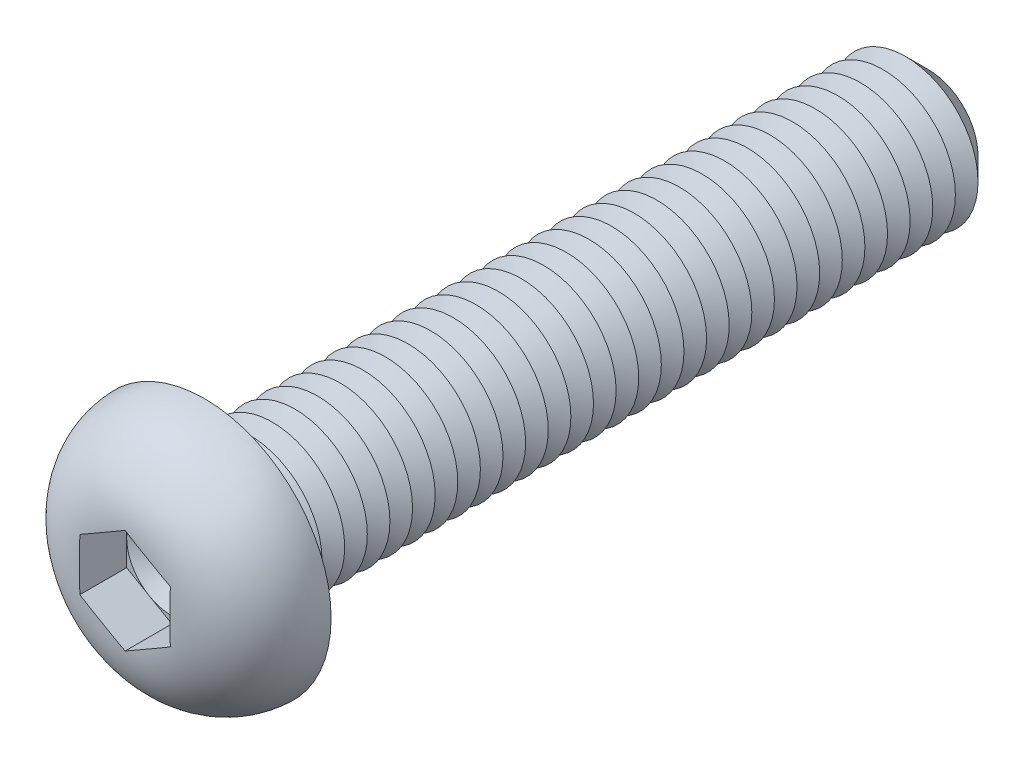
ISO-10303-21;
HEADER;
FILE_DESCRIPTION(('STEP AP214'),'2;1');
FILE_NAME('part.step','',(''),(''),'','','');
FILE_SCHEMA(('AUTOMOTIVE_DESIGN { 1 0 10303 214 1 1 1 1 }'));
ENDSEC;
DATA;
#1=APPLICATION_CONTEXT('core data for automotive mechanical design processes');
#2=APPLICATION_PROTOCOL_DEFINITION('international standard','automotive_design',2000,#1);
#3=PRODUCT_CONTEXT('',#1,'mechanical');
#4=PRODUCT('Part','Part','',(#3));
#5=PRODUCT_RELATED_PRODUCT_CATEGORY('part','',(#4));
#6=PRODUCT_DEFINITION_FORMATION('','',#4);
#7=PRODUCT_DEFINITION_CONTEXT('part definition',#1,'design');
#8=PRODUCT_DEFINITION('design','',#6,#7);
#9=PRODUCT_DEFINITION_SHAPE('','',#8);
#10=(LENGTH_UNIT() NAMED_UNIT(*) SI_UNIT(.MILLI.,.METRE.));
#11=(NAMED_UNIT(*) PLANE_ANGLE_UNIT() SI_UNIT($,.RADIAN.));
#12=(NAMED_UNIT(*) SI_UNIT($,.STERADIAN.) SOLID_ANGLE_UNIT());
#13=UNCERTAINTY_MEASURE_WITH_UNIT(LENGTH_MEASURE(1.E-05),#10,'distance_accuracy_value','');
#14=(GEOMETRIC_REPRESENTATION_CONTEXT(3) GLOBAL_UNCERTAINTY_ASSIGNED_CONTEXT((#13)) GLOBAL_UNIT_ASSIGNED_CONTEXT((#10,
#11,#12)) REPRESENTATION_CONTEXT('',''));
#15=CARTESIAN_POINT('',(0.,0.,0.));
#16=DIRECTION('',(0.,0.,1.));
#17=DIRECTION('',(1.,0.,0.));
#18=AXIS2_PLACEMENT_3D('',#15,#16,#17);
#19=CARTESIAN_POINT('',(0.,0.,1.8));
#20=DIRECTION('',(0.,0.,1.));
#21=DIRECTION('',(1.,0.,0.));
#22=AXIS2_PLACEMENT_3D('',#19,#20,#21);
#23=PLANE('',#22);
#24=CARTESIAN_POINT('',(0.,0.,1.8));
#25=DIRECTION('',(0.,0.,1.));
#26=DIRECTION('',(1.,0.,0.));
#27=AXIS2_PLACEMENT_3D('',#24,#25,#26);
#28=CIRCLE('',#27,2.5);
#29=CARTESIAN_POINT('',(2.5,0.,1.8));
#30=VERTEX_POINT('',#29);
#31=CARTESIAN_POINT('',(1.25,2.1650635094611,1.8));
#32=VERTEX_POINT('',#31);
#33=EDGE_CURVE('E153',#30,#32,#28,.T.);
#34=ORIENTED_EDGE('',*,*,#33,.F.);
#35=DIRECTION('',(0.,1.,0.));
#36=VECTOR('',#35,1.);
#37=CARTESIAN_POINT('',(2.5,-1.44337567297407,1.8));
#38=LINE('',#37,#36);
#39=CARTESIAN_POINT('',(2.5,1.44337567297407,1.8));
#40=VERTEX_POINT('',#39);
#41=EDGE_CURVE('E176',#30,#40,#38,.T.);
#42=ORIENTED_EDGE('',*,*,#41,.T.);
#43=DIRECTION('',(-0.866025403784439,0.5,0.));
#44=VECTOR('',#43,1.);
#45=CARTESIAN_POINT('',(2.5,1.44337567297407,1.8));
#46=LINE('',#45,#44);
#47=EDGE_CURVE('E172',#40,#32,#46,.T.);
#48=ORIENTED_EDGE('',*,*,#47,.T.);
#49=EDGE_LOOP('',(#34,#42,#48));
#50=FACE_BOUND('',#49,.T.);
#51=ADVANCED_FACE('F39',(#50),#23,.T.);
#52=CARTESIAN_POINT('',(0.,0.,1.8));
#53=DIRECTION('',(0.,0.,1.));
#54=DIRECTION('',(1.,0.,0.));
#55=AXIS2_PLACEMENT_3D('',#52,#53,#54);
#56=CIRCLE('',#55,2.5);
#57=CARTESIAN_POINT('',(-1.25,2.1650635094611,1.8));
#58=VERTEX_POINT('',#57);
#59=EDGE_CURVE('E11',#32,#58,#56,.T.);
#60=ORIENTED_EDGE('',*,*,#59,.F.);
#61=CARTESIAN_POINT('',(0.,2.88675134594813,1.8));
#62=VERTEX_POINT('',#61);
#63=EDGE_CURVE('E166',#32,#62,#46,.T.);
#64=ORIENTED_EDGE('',*,*,#63,.T.);
#65=DIRECTION('',(-0.866025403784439,-0.5,0.));
#66=VECTOR('',#65,1.);
#67=CARTESIAN_POINT('',(0.,2.88675134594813,1.8));
#68=LINE('',#67,#66);
#69=EDGE_CURVE('E167',#62,#58,#68,.T.);
#70=ORIENTED_EDGE('',*,*,#69,.T.);
#71=EDGE_LOOP('',(#60,#64,#70));
#72=FACE_BOUND('',#71,.T.);
#73=ADVANCED_FACE('F165',(#72),#23,.T.);
#74=CARTESIAN_POINT('',(-2.5,0.,1.8));
#75=VERTEX_POINT('',#74);
#76=EDGE_CURVE('E49',#58,#75,#56,.T.);
#77=ORIENTED_EDGE('',*,*,#76,.F.);
#78=CARTESIAN_POINT('',(-2.5,1.44337567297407,1.8));
#79=VERTEX_POINT('',#78);
#80=EDGE_CURVE('E179',#58,#79,#68,.T.);
#81=ORIENTED_EDGE('',*,*,#80,.T.);
#82=DIRECTION('',(0.,-1.,0.));
#83=VECTOR('',#82,1.);
#84=CARTESIAN_POINT('',(-2.5,1.44337567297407,1.8));
#85=LINE('',#84,#83);
#86=EDGE_CURVE('E190',#79,#75,#85,.T.);
#87=ORIENTED_EDGE('',*,*,#86,.T.);
#88=EDGE_LOOP('',(#77,#81,#87));
#89=FACE_BOUND('',#88,.T.);
#90=ADVANCED_FACE('F440',(#89),#23,.T.);
#91=CARTESIAN_POINT('',(-1.25,-2.1650635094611,1.8));
#92=VERTEX_POINT('',#91);
#93=EDGE_CURVE('E422',#75,#92,#56,.T.);
#94=ORIENTED_EDGE('',*,*,#93,.F.);
#95=CARTESIAN_POINT('',(-2.5,-1.44337567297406,1.8));
#96=VERTEX_POINT('',#95);
#97=EDGE_CURVE('E189',#75,#96,#85,.T.);
#98=ORIENTED_EDGE('',*,*,#97,.T.);
#99=DIRECTION('',(0.866025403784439,-0.5,0.));
#100=VECTOR('',#99,1.);
#101=CARTESIAN_POINT('',(-2.5,-1.44337567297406,1.8));
#102=LINE('',#101,#100);
#103=EDGE_CURVE('E195',#96,#92,#102,.T.);
#104=ORIENTED_EDGE('',*,*,#103,.T.);
#105=EDGE_LOOP('',(#94,#98,#104));
#106=FACE_BOUND('',#105,.T.);
#107=ADVANCED_FACE('F435',(#106),#23,.T.);
#108=CARTESIAN_POINT('',(1.25,-2.1650635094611,1.8));
#109=VERTEX_POINT('',#108);
#110=EDGE_CURVE('E56',#92,#109,#56,.T.);
#111=ORIENTED_EDGE('',*,*,#110,.F.);
#112=CARTESIAN_POINT('',(0.,-2.88675134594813,1.8));
#113=VERTEX_POINT('',#112);
#114=EDGE_CURVE('E194',#92,#113,#102,.T.);
#115=ORIENTED_EDGE('',*,*,#114,.T.);
#116=DIRECTION('',(0.866025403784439,0.5,0.));
#117=VECTOR('',#116,1.);
#118=CARTESIAN_POINT('',(0.,-2.88675134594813,1.8));
#119=LINE('',#118,#117);
#120=EDGE_CURVE('E200',#113,#109,#119,.T.);
#121=ORIENTED_EDGE('',*,*,#120,.T.);
#122=EDGE_LOOP('',(#111,#115,#121));
#123=FACE_BOUND('',#122,.T.);
#124=ADVANCED_FACE('F476',(#123),#23,.T.);
#125=CARTESIAN_POINT('',(0.,0.,-40.));
#126=DIRECTION('',(0.,0.,1.));
#127=DIRECTION('',(1.,0.,0.));
#128=AXIS2_PLACEMENT_3D('',#125,#126,#127);
#129=CYLINDRICAL_SURFACE('',#128,4.);
#130=CARTESIAN_POINT('',(0.,0.,-0.5));
#131=DIRECTION('',(0.,0.,1.));
#132=DIRECTION('',(1.,0.,0.));
#133=AXIS2_PLACEMENT_3D('',#130,#131,#132);
#134=CIRCLE('',#133,4.);
#135=CARTESIAN_POINT('',(4.,0.,-0.5));
#136=VERTEX_POINT('',#135);
#137=EDGE_CURVE('E411',#136,#136,#134,.F.);
#138=ORIENTED_EDGE('',*,*,#137,.T.);
#139=EDGE_LOOP('',(#138));
#140=FACE_BOUND('',#139,.T.);
#141=CARTESIAN_POINT('',(0.,0.,-1.25));
#142=DIRECTION('',(0.,0.,1.));
#143=DIRECTION('',(1.,0.,0.));
#144=AXIS2_PLACEMENT_3D('',#141,#142,#143);
#145=CIRCLE('',#144,4.00000000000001);
#146=CARTESIAN_POINT('',(4.00000000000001,0.,-1.25));
#147=VERTEX_POINT('',#146);
#148=EDGE_CURVE('E185',#147,#147,#145,.T.);
#149=ORIENTED_EDGE('',*,*,#148,.T.);
#150=EDGE_LOOP('',(#149));
#151=FACE_BOUND('',#150,.T.);
#152=ADVANCED_FACE('F471',(#140,#151),#129,.T.);
#153=CARTESIAN_POINT('',(0.,7.,0.));
#154=DIRECTION('',(0.,0.,1.));
#155=DIRECTION('',(1.,0.,0.));
#156=AXIS2_PLACEMENT_3D('',#153,#154,#155);
#157=PLANE('',#156);
#158=CARTESIAN_POINT('',(0.,0.,0.));
#159=DIRECTION('',(0.,0.,1.));
#160=DIRECTION('',(1.,0.,0.));
#161=AXIS2_PLACEMENT_3D('',#158,#159,#160);
#162=CIRCLE('',#161,4.5);
#163=CARTESIAN_POINT('',(4.5,0.,0.));
#164=VERTEX_POINT('',#163);
#165=EDGE_CURVE('E414',#164,#164,#162,.T.);
#166=ORIENTED_EDGE('',*,*,#165,.T.);
#167=EDGE_LOOP('',(#166));
#168=FACE_BOUND('',#167,.T.);
#169=CARTESIAN_POINT('',(0.,0.,0.));
#170=DIRECTION('',(0.,0.,1.));
#171=DIRECTION('',(1.,0.,0.));
#172=AXIS2_PLACEMENT_3D('',#169,#170,#171);
#173=CIRCLE('',#172,7.);
#174=CARTESIAN_POINT('',(7.,0.,0.));
#175=VERTEX_POINT('',#174);
#176=EDGE_CURVE('E211',#175,#175,#173,.T.);
#177=ORIENTED_EDGE('',*,*,#176,.F.);
#178=EDGE_LOOP('',(#177));
#179=FACE_BOUND('',#178,.T.);
#180=ADVANCED_FACE('F469',(#168,#179),#157,.F.);
#181=CARTESIAN_POINT('',(0.,0.,-0.1));
#182=DIRECTION('',(0.,0.,1.));
#183=DIRECTION('',(1.,0.,0.));
#184=AXIS2_PLACEMENT_3D('',#181,#182,#183);
#185=DEGENERATE_TOROIDAL_SURFACE('',#184,2.5011112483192,4.5,.T.);
#186=CARTESIAN_POINT('',(1.31456088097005,2.12778926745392,4.4));
#187=DIRECTION('',(-0.866025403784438,0.500000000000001,0.));
#188=VECTOR('',#187,1.);
#189=LINE('',#186,#188);
#190=CARTESIAN_POINT('',(1.31456088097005,2.12778926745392,4.4));
#191=VERTEX_POINT('',#190);
#192=CARTESIAN_POINT('',(1.18543911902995,2.20233775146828,4.4));
#193=VERTEX_POINT('',#192);
#194=EDGE_CURVE('E399',#191,#193,#189,.T.);
#195=ORIENTED_EDGE('',*,*,#194,.F.);
#196=CARTESIAN_POINT('',(-0.000200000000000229,2.88686681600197,4.38343536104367));
#197=CARTESIAN_POINT('',(0.103935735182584,2.82674402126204,4.38859262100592));
#198=CARTESIAN_POINT('',(0.208111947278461,2.76659785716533,4.39207570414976));
#199=CARTESIAN_POINT('',(0.416486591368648,2.64629270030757,4.39683754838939));
#200=CARTESIAN_POINT('',(0.520685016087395,2.58613371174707,4.39811670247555));
#201=CARTESIAN_POINT('',(0.729066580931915,2.46582455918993,4.3996156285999));
#202=CARTESIAN_POINT('',(0.833249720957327,2.40567439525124,4.39983556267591));
#203=CARTESIAN_POINT('',(1.04162190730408,2.2853706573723,4.4000276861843));
#204=CARTESIAN_POINT('',(1.14581095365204,2.2252170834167,4.39999986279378));
#205=CARTESIAN_POINT('',(1.35418904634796,2.10490993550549,4.39999986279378));
#206=CARTESIAN_POINT('',(1.45837809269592,2.04475636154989,4.4000276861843));
#207=CARTESIAN_POINT('',(1.66675027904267,1.92445262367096,4.39983556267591));
#208=CARTESIAN_POINT('',(1.77093341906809,1.86430245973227,4.3996156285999));
#209=CARTESIAN_POINT('',(1.97931498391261,1.74399330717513,4.39811670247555));
#210=CARTESIAN_POINT('',(2.08351340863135,1.68383431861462,4.39683754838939));
#211=CARTESIAN_POINT('',(2.29188805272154,1.56352916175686,4.39207570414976));
#212=CARTESIAN_POINT('',(2.39606426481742,1.50338299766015,4.38859262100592));
#213=CARTESIAN_POINT('',(2.5002,1.44326020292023,4.38343536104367));
#214=B_SPLINE_CURVE_WITH_KNOTS('',3,(#196,#197,#198,#199,#200,#201,#202,#203,#204,#205,#206,
#207,#208,#209,#210,#211,#212,#213),.UNSPECIFIED.,.F.,.F.,(4,2,2,2,2,2,2,2,4),(0.,
0.361022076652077,0.721979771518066,1.08288224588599,1.44380339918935,1.80472455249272,
2.16562702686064,2.52658472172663,2.88760679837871),.UNSPECIFIED.);
#215=CARTESIAN_POINT('',(2.5,1.44337567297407,4.38344529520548));
#216=VERTEX_POINT('',#215);
#217=EDGE_CURVE('E355',#191,#216,#214,.T.);
#218=ORIENTED_EDGE('',*,*,#217,.T.);
#219=CARTESIAN_POINT('',(2.5,0.,4.39999986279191));
#220=CARTESIAN_POINT('',(2.5,-0.104697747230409,4.39999811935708));
#221=CARTESIAN_POINT('',(2.5,-0.209395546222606,4.40001551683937));
#222=CARTESIAN_POINT('',(2.5,-0.418792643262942,4.39990807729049));
#223=CARTESIAN_POINT('',(2.5,-0.52349194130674,4.39978323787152));
#224=CARTESIAN_POINT('',(2.5,-0.732936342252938,4.39891238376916));
#225=CARTESIAN_POINT('',(2.5,-0.837681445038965,4.39816609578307));
#226=CARTESIAN_POINT('',(2.5,-1.04715282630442,4.39536239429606));
#227=CARTESIAN_POINT('',(2.5,-1.15187910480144,4.39330498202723));
#228=CARTESIAN_POINT('',(2.5,-1.46476484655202,4.38400647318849));
#229=CARTESIAN_POINT('',(2.5,-1.67286375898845,4.37365196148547));
#230=CARTESIAN_POINT('',(2.5,-2.08783281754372,4.33852954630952));
#231=CARTESIAN_POINT('',(2.5,-2.29470379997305,4.31377296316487));
#232=CARTESIAN_POINT('',(2.5,-2.64451002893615,4.25536510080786));
#233=CARTESIAN_POINT('',(2.5,-2.78823975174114,4.22651785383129));
#234=CARTESIAN_POINT('',(2.5,-3.073224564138,4.15827060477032));
#235=CARTESIAN_POINT('',(2.5,-3.21447933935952,4.11886927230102));
#236=CARTESIAN_POINT('',(2.5,-3.49353952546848,4.02870287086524));
#237=CARTESIAN_POINT('',(2.5,-3.6313402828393,3.97792330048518));
#238=CARTESIAN_POINT('',(2.5,-3.90204977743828,3.86463774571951));
#239=CARTESIAN_POINT('',(2.5,-4.0349587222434,3.8021322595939));
#240=CARTESIAN_POINT('',(2.5,-4.2956525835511,3.66474880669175));
#241=CARTESIAN_POINT('',(2.5,-4.42338586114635,3.58977252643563));
#242=CARTESIAN_POINT('',(2.5,-4.67118559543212,3.42803136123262));
#243=CARTESIAN_POINT('',(2.5,-4.79125159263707,3.3412657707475));
#244=CARTESIAN_POINT('',(2.5,-5.02233156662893,3.15645800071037));
#245=CARTESIAN_POINT('',(2.5,-5.13334771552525,3.05841854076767));
#246=CARTESIAN_POINT('',(2.5,-5.34506083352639,2.85177471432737));
#247=CARTESIAN_POINT('',(2.5,-5.44575933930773,2.74317192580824));
#248=CARTESIAN_POINT('',(2.5,-5.62335564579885,2.53102225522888));
#249=CARTESIAN_POINT('',(2.5,-5.70164721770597,2.42863868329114));
#250=CARTESIAN_POINT('',(2.5,-5.84882394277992,2.21725758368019));
#251=CARTESIAN_POINT('',(2.5,-5.91770588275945,2.10825781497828));
#252=CARTESIAN_POINT('',(2.5,-6.04532926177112,1.88460009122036));
#253=CARTESIAN_POINT('',(2.5,-6.1040794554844,1.76994713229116));
#254=CARTESIAN_POINT('',(2.5,-6.21098181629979,1.53574793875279));
#255=CARTESIAN_POINT('',(2.5,-6.25913021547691,1.41619998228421));
#256=CARTESIAN_POINT('',(2.5,-6.34173830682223,1.18065209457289));
#257=CARTESIAN_POINT('',(2.5,-6.37685491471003,1.06488207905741));
#258=CARTESIAN_POINT('',(2.5,-6.43703913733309,0.830714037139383));
#259=CARTESIAN_POINT('',(2.5,-6.46210319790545,0.712315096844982));
#260=CARTESIAN_POINT('',(2.5,-6.50194044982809,0.473848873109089));
#261=CARTESIAN_POINT('',(2.5,-6.51671856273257,0.353782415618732));
#262=CARTESIAN_POINT('',(2.5,-6.53588982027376,0.112808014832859));
#263=CARTESIAN_POINT('',(2.5,-6.54027911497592,-0.00810022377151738));
#264=CARTESIAN_POINT('',(2.5,-6.53779027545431,-0.365870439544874));
#265=CARTESIAN_POINT('',(2.5,-6.51607942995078,-0.602790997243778));
#266=CARTESIAN_POINT('',(2.5,-6.43310265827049,-1.06957107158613));
#267=CARTESIAN_POINT('',(2.5,-6.3718398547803,-1.29943114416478));
#268=CARTESIAN_POINT('',(2.5,-6.25195024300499,-1.63390601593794));
#269=CARTESIAN_POINT('',(2.5,-6.20730237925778,-1.74371189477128));
#270=CARTESIAN_POINT('',(2.5,-6.10902350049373,-1.95921136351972));
#271=CARTESIAN_POINT('',(2.5,-6.05539567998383,-2.06490639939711));
#272=CARTESIAN_POINT('',(2.5,-5.93955620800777,-2.27152527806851));
#273=CARTESIAN_POINT('',(2.5,-5.87734126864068,-2.37244727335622));
#274=CARTESIAN_POINT('',(2.5,-5.7448545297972,-2.56880727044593));
#275=CARTESIAN_POINT('',(2.5,-5.67458537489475,-2.6642470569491));
#276=CARTESIAN_POINT('',(2.5,-5.52523018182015,-2.85070592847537));
#277=CARTESIAN_POINT('',(2.5,-5.44601185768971,-2.94161901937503));
#278=CARTESIAN_POINT('',(2.5,-5.28044044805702,-3.11663859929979));
#279=CARTESIAN_POINT('',(2.5,-5.194089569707,-3.2007471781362));
#280=CARTESIAN_POINT('',(2.5,-5.01485870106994,-3.36178408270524));
#281=CARTESIAN_POINT('',(2.5,-4.92197538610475,-3.43870870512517));
#282=CARTESIAN_POINT('',(2.5,-4.73045535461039,-3.58495812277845));
#283=CARTESIAN_POINT('',(2.5,-4.6318202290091,-3.65428500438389));
#284=CARTESIAN_POINT('',(2.5,-4.4247626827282,-3.78818551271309));
#285=CARTESIAN_POINT('',(2.5,-4.31609824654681,-3.85238474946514));
#286=CARTESIAN_POINT('',(2.5,-4.0940582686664,-3.97208975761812));
#287=CARTESIAN_POINT('',(2.5,-3.98068153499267,-4.02759331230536));
#288=CARTESIAN_POINT('',(2.5,-3.75029026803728,-4.12981004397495));
#289=CARTESIAN_POINT('',(2.5,-3.63328275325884,-4.17653908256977));
#290=CARTESIAN_POINT('',(2.5,-3.39631992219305,-4.2614893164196));
#291=CARTESIAN_POINT('',(2.5,-3.27636651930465,-4.29971587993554));
#292=CARTESIAN_POINT('',(2.5,-3.00446622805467,-4.37644925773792));
#293=CARTESIAN_POINT('',(2.5,-2.85188931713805,-4.41272455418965));
#294=CARTESIAN_POINT('',(2.5,-2.54443794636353,-4.47385449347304));
#295=CARTESIAN_POINT('',(2.5,-2.3895624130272,-4.49870361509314));
#296=CARTESIAN_POINT('',(2.5,-2.07807451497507,-4.53870829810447));
#297=CARTESIAN_POINT('',(2.5,-1.92145805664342,-4.55383091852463));
#298=CARTESIAN_POINT('',(2.5,-1.60772330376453,-4.57647936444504));
#299=CARTESIAN_POINT('',(2.5,-1.45060502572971,-4.58400543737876));
#300=CARTESIAN_POINT('',(2.5,-1.13432460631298,-4.59416656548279));
#301=CARTESIAN_POINT('',(2.5,-0.975160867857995,-4.59674096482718));
#302=CARTESIAN_POINT('',(2.5,-0.656826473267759,-4.59957813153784));
#303=CARTESIAN_POINT('',(2.5,-0.497655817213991,-4.59984092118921));
#304=CARTESIAN_POINT('',(2.5,-0.179547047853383,-4.60005428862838));
#305=CARTESIAN_POINT('',(2.5,-0.02060893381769,-4.60000532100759));
#306=CARTESIAN_POINT('',(2.5,0.297265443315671,-4.59999304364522));
#307=CARTESIAN_POINT('',(2.5,0.456201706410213,-4.60002973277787));
#308=CARTESIAN_POINT('',(2.5,0.70967559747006,-4.59902611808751));
#309=CARTESIAN_POINT('',(2.5,0.804213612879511,-4.59841616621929));
#310=CARTESIAN_POINT('',(2.5,0.99327694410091,-4.59620676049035));
#311=CARTESIAN_POINT('',(2.5,1.08780225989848,-4.59460730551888));
#312=CARTESIAN_POINT('',(2.5,1.37137837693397,-4.58746770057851));
#313=CARTESIAN_POINT('',(2.5,1.56039301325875,-4.57958602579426));
#314=CARTESIAN_POINT('',(2.5,1.93609462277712,-4.55305686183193));
#315=CARTESIAN_POINT('',(2.5,2.12278756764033,-4.53450331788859));
#316=CARTESIAN_POINT('',(2.5,2.49421016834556,-4.48296248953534));
#317=CARTESIAN_POINT('',(2.5,2.67894050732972,-4.44998040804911));
#318=CARTESIAN_POINT('',(2.5,2.99962701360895,-4.37718406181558));
#319=CARTESIAN_POINT('',(2.5,3.13641465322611,-4.34103978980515));
#320=CARTESIAN_POINT('',(2.5,3.40682838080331,-4.25834226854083));
#321=CARTESIAN_POINT('',(2.5,3.54045461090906,-4.21178948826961));
#322=CARTESIAN_POINT('',(2.5,3.80387940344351,-4.1076796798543));
#323=CARTESIAN_POINT('',(2.5,3.93366385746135,-4.05008679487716));
#324=CARTESIAN_POINT('',(2.5,4.18776789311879,-3.92385886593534));
#325=CARTESIAN_POINT('',(2.5,4.31208736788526,-3.85522360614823));
#326=CARTESIAN_POINT('',(2.5,4.55475418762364,-3.70660227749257));
#327=CARTESIAN_POINT('',(2.5,4.67306276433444,-3.62655275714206));
#328=CARTESIAN_POINT('',(2.5,4.90171316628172,-3.45576294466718));
#329=CARTESIAN_POINT('',(2.5,5.01205476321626,-3.36502234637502));
#330=CARTESIAN_POINT('',(2.5,5.22347091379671,-3.17353376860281));
#331=CARTESIAN_POINT('',(2.5,5.32455555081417,-3.07279693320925));
#332=CARTESIAN_POINT('',(2.5,5.51647993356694,-2.86200023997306));
#333=CARTESIAN_POINT('',(2.5,5.6073208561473,-2.75194145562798));
#334=CARTESIAN_POINT('',(2.5,5.76832451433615,-2.53607083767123));
#335=CARTESIAN_POINT('',(2.5,5.83966300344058,-2.4311337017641));
#336=CARTESIAN_POINT('',(2.5,5.97282702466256,-2.2153291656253));
#337=CARTESIAN_POINT('',(2.5,6.03464926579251,-2.10445973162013));
#338=CARTESIAN_POINT('',(2.5,6.14815657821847,-1.87771731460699));
#339=CARTESIAN_POINT('',(2.5,6.19984675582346,-1.76184688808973));
#340=CARTESIAN_POINT('',(2.5,6.29267395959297,-1.52590109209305));
#341=CARTESIAN_POINT('',(2.5,6.33380720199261,-1.40582423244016));
#342=CARTESIAN_POINT('',(2.5,6.40328888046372,-1.16869740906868));
#343=CARTESIAN_POINT('',(2.5,6.43218419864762,-1.05180738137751));
#344=CARTESIAN_POINT('',(2.5,6.47988151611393,-0.815941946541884));
#345=CARTESIAN_POINT('',(2.5,6.49867991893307,-0.696965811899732));
#346=CARTESIAN_POINT('',(2.5,6.52599950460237,-0.457898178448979));
#347=CARTESIAN_POINT('',(2.5,6.53452634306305,-0.337807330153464));
#348=CARTESIAN_POINT('',(2.5,6.54126106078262,-0.0973214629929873));
#349=CARTESIAN_POINT('',(2.5,6.5394651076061,0.023073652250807));
#350=CARTESIAN_POINT('',(2.5,6.51879545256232,0.379398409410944));
#351=CARTESIAN_POINT('',(2.5,6.48510560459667,0.614630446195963));
#352=CARTESIAN_POINT('',(2.5,6.37872360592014,1.07608887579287));
#353=CARTESIAN_POINT('',(2.5,6.30603128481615,1.3023152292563));
#354=CARTESIAN_POINT('',(2.5,6.16957161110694,1.63028303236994));
#355=CARTESIAN_POINT('',(2.5,6.11941470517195,1.7378698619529));
#356=CARTESIAN_POINT('',(2.5,6.01034124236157,1.94849153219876));
#357=CARTESIAN_POINT('',(2.5,5.9514277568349,2.05152795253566));
#358=CARTESIAN_POINT('',(2.5,5.82528890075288,2.25240256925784));
#359=CARTESIAN_POINT('',(2.5,5.75806159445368,2.35023954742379));
#360=CARTESIAN_POINT('',(2.5,5.61585543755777,2.54005689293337));
#361=CARTESIAN_POINT('',(2.5,5.54087908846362,2.63203913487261));
#362=CARTESIAN_POINT('',(2.5,5.38212190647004,2.81146438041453));
#363=CARTESIAN_POINT('',(2.5,5.29819182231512,2.89877528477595));
#364=CARTESIAN_POINT('',(2.5,5.12353712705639,3.06625194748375));
#365=CARTESIAN_POINT('',(2.5,5.03281455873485,3.14641983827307));
#366=CARTESIAN_POINT('',(2.5,4.84518171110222,3.29930665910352));
#367=CARTESIAN_POINT('',(2.5,4.74826657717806,3.37201962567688));
#368=CARTESIAN_POINT('',(2.5,4.54907485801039,3.50961479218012));
#369=CARTESIAN_POINT('',(2.5,4.44679969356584,3.57449905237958));
#370=CARTESIAN_POINT('',(2.5,4.23202545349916,3.69953578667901));
#371=CARTESIAN_POINT('',(2.5,4.11927203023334,3.75925114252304));
#372=CARTESIAN_POINT('',(2.5,3.88947986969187,3.86977617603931));
#373=CARTESIAN_POINT('',(2.5,3.77244067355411,3.92058489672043));
#374=CARTESIAN_POINT('',(2.5,3.5351804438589,4.0133148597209));
#375=CARTESIAN_POINT('',(2.5,3.41496637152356,4.0552539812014));
#376=CARTESIAN_POINT('',(2.5,3.17195278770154,4.13067246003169));
#377=CARTESIAN_POINT('',(2.5,3.04915378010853,4.16415344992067));
#378=CARTESIAN_POINT('',(2.5,2.80683027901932,4.22194717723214));
#379=CARTESIAN_POINT('',(2.5,2.68738216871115,4.2465834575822));
#380=CARTESIAN_POINT('',(2.5,2.44729214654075,4.28920746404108));
#381=CARTESIAN_POINT('',(2.5,2.32664997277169,4.30719369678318));
#382=CARTESIAN_POINT('',(2.5,2.08450864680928,4.33736171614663));
#383=CARTESIAN_POINT('',(2.5,1.9630086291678,4.3495363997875));
#384=CARTESIAN_POINT('',(2.5,1.71961501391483,4.36908103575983));
#385=CARTESIAN_POINT('',(2.5,1.59772134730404,4.37645009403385));
#386=CARTESIAN_POINT('',(2.5,1.35283283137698,4.38761579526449));
#387=CARTESIAN_POINT('',(2.5,1.22983679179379,4.39138420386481));
#388=CARTESIAN_POINT('',(2.5,0.983808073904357,4.3965493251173));
#389=CARTESIAN_POINT('',(2.5,0.860775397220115,4.3979461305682));
#390=CARTESIAN_POINT('',(2.5,0.614783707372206,4.39958107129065));
#391=CARTESIAN_POINT('',(2.5,0.491824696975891,4.3998199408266));
#392=CARTESIAN_POINT('',(2.5,0.245910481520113,4.40003035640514));
#393=CARTESIAN_POINT('',(2.5,0.122955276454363,4.4000019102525));
#394=CARTESIAN_POINT('',(2.5,0.,4.39999986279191));
#395=B_SPLINE_CURVE_WITH_KNOTS('',3,(#219,#220,#221,#222,#223,#224,#225,#226,#227,#228,#229,
#230,#231,#232,#233,#234,#235,#236,#237,#238,#239,#240,#241,#242,#243,#244,#245,#246,#247,#248,
#249,#250,#251,#252,#253,#254,#255,#256,#257,#258,#259,#260,#261,#262,#263,#264,#265,#266,#267,
#268,#269,#270,#271,#272,#273,#274,#275,#276,#277,#278,#279,#280,#281,#282,#283,#284,#285,#286,
#287,#288,#289,#290,#291,#292,#293,#294,#295,#296,#297,#298,#299,#300,#301,#302,#303,#304,#305,
#306,#307,#308,#309,#310,#311,#312,#313,#314,#315,#316,#317,#318,#319,#320,#321,#322,#323,#324,
#325,#326,#327,#328,#329,#330,#331,#332,#333,#334,#335,#336,#337,#338,#339,#340,#341,#342,#343,
#344,#345,#346,#347,#348,#349,#350,#351,#352,#353,#354,#355,#356,#357,#358,#359,#360,#361,#362,
#363,#364,#365,#366,#367,#368,#369,#370,#371,#372,#373,#374,#375,#376,#377,#378,#379,#380,#381,
#382,#383,#384,#385,#386,#387,#388,#389,#390,#391,#392,#393,#394),.UNSPECIFIED.,.T.,.F.,(4,2,2,
2,2,2,2,2,2,2,2,2,2,2,2,2,2,2,2,2,2,2,2,2,2,2,2,2,2,2,2,2,2,2,2,2,2,2,2,2,2,2,2,2,2,2,2,2,2,2,2,
2,2,2,2,2,2,2,2,2,2,2,2,2,2,2,2,2,2,2,2,2,2,2,2,2,2,2,2,2,2,2,2,2,2,2,2,4),(0.,
0.314093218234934,0.62819170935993,0.942428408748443,1.25666481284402,1.88144147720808,
2.50572771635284,2.94516878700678,3.38466527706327,3.82472511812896,4.26476626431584,
4.70845695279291,5.15217420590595,5.59578464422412,6.03932891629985,6.42549664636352,
6.81179591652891,7.19775970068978,7.58386043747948,7.94635637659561,8.30898036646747,
8.67143073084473,9.03401539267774,9.74414367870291,10.4542159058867,10.8094792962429,
11.1646165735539,11.5198902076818,11.8750475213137,12.2363927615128,12.597626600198,
12.9590456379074,13.3203651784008,13.698597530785,14.0769261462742,14.4545641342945,
14.8319630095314,15.3019396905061,15.7721432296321,16.2439309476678,16.715703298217,
17.1932187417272,17.6707295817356,18.1475442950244,18.6243527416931,18.9079682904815,
19.1915841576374,19.7589248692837,20.3213460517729,20.8835645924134,21.3076400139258,
21.731696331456,22.1571540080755,22.5826200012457,23.0105507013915,23.4384936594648,
23.8659647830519,24.2933867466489,24.6735755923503,25.0538956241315,25.4340234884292,
25.8142874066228,26.1750761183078,26.5359932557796,26.8967115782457,27.2575638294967,
27.9668653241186,28.6761699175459,29.0319382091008,29.3875820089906,29.7433087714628,
30.0989210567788,30.4618400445,30.8246503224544,31.1877485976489,31.5507511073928,
31.9331198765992,32.3155297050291,32.6971611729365,33.0787189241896,33.4443988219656,
33.8101607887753,34.1763686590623,34.54264464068,34.9117697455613,35.2808804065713,
35.6497569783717,36.0186227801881),.UNSPECIFIED.);
#396=CARTESIAN_POINT('',(2.5,0.0745484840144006,4.4));
#397=VERTEX_POINT('',#396);
#398=EDGE_CURVE('E345',#216,#397,#395,.T.);
#399=ORIENTED_EDGE('',*,*,#398,.T.);
#400=CARTESIAN_POINT('',(2.5,-0.0745484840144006,4.4));
#401=DIRECTION('',(0.,1.,0.));
#402=VECTOR('',#401,1.);
#403=LINE('',#400,#402);
#404=CARTESIAN_POINT('',(2.5,-0.0745484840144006,4.4));
#405=VERTEX_POINT('',#404);
#406=EDGE_CURVE('E174',#405,#397,#403,.T.);
#407=ORIENTED_EDGE('',*,*,#406,.F.);
#408=CARTESIAN_POINT('',(2.5,-1.44337567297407,4.38344529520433));
#409=VERTEX_POINT('',#408);
#410=EDGE_CURVE('E356',#405,#409,#395,.T.);
#411=ORIENTED_EDGE('',*,*,#410,.T.);
#412=CARTESIAN_POINT('',(2.5002,-1.44326020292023,4.38343536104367));
#413=CARTESIAN_POINT('',(2.39606426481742,-1.50338299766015,4.38859262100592));
#414=CARTESIAN_POINT('',(2.29188805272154,-1.56352916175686,4.39207570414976));
#415=CARTESIAN_POINT('',(2.08351340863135,-1.68383431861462,4.39683754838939));
#416=CARTESIAN_POINT('',(1.9793149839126,-1.74399330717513,4.39811670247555));
#417=CARTESIAN_POINT('',(1.77093341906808,-1.86430245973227,4.3996156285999));
#418=CARTESIAN_POINT('',(1.66675027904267,-1.92445262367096,4.39983556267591));
#419=CARTESIAN_POINT('',(1.45837809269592,-2.04475636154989,4.4000276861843));
#420=CARTESIAN_POINT('',(1.35418904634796,-2.10490993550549,4.39999986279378));
#421=CARTESIAN_POINT('',(1.14581095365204,-2.2252170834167,4.39999986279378));
#422=CARTESIAN_POINT('',(1.04162190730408,-2.2853706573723,4.4000276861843));
#423=CARTESIAN_POINT('',(0.833249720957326,-2.40567439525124,4.39983556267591));
#424=CARTESIAN_POINT('',(0.729066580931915,-2.46582455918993,4.3996156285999));
#425=CARTESIAN_POINT('',(0.520685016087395,-2.58613371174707,4.39811670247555));
#426=CARTESIAN_POINT('',(0.416486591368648,-2.64629270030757,4.39683754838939));
#427=CARTESIAN_POINT('',(0.208111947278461,-2.76659785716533,4.39207570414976));
#428=CARTESIAN_POINT('',(0.103935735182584,-2.82674402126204,4.38859262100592));
#429=CARTESIAN_POINT('',(-0.000200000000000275,-2.88686681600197,4.38343536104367));
#430=B_SPLINE_CURVE_WITH_KNOTS('',3,(#412,#413,#414,#415,#416,#417,#418,#419,#420,#421,#422,
#423,#424,#425,#426,#427,#428,#429),.UNSPECIFIED.,.F.,.F.,(4,2,2,2,2,2,2,2,4),(0.,
0.361022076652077,0.721979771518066,1.08288224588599,1.44380339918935,1.80472455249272,
2.16562702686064,2.52658472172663,2.88760679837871),.UNSPECIFIED.);
#431=CARTESIAN_POINT('',(1.31456088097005,-2.12778926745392,4.4));
#432=VERTEX_POINT('',#431);
#433=EDGE_CURVE('E332',#409,#432,#430,.T.);
#434=ORIENTED_EDGE('',*,*,#433,.T.);
#435=CARTESIAN_POINT('',(1.18543911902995,-2.20233775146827,4.4));
#436=DIRECTION('',(0.866025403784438,0.500000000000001,0.));
#437=VECTOR('',#436,1.);
#438=LINE('',#435,#437);
#439=CARTESIAN_POINT('',(1.18543911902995,-2.20233775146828,4.4));
#440=VERTEX_POINT('',#439);
#441=EDGE_CURVE('E341',#440,#432,#438,.T.);
#442=ORIENTED_EDGE('',*,*,#441,.F.);
#443=CARTESIAN_POINT('',(0.,-2.88675134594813,4.38344529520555));
#444=VERTEX_POINT('',#443);
#445=EDGE_CURVE('E295',#440,#444,#430,.T.);
#446=ORIENTED_EDGE('',*,*,#445,.T.);
#447=CARTESIAN_POINT('',(0.00019999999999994,-2.88686681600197,4.38343536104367));
#448=CARTESIAN_POINT('',(-0.103935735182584,-2.82674402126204,4.38859262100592));
#449=CARTESIAN_POINT('',(-0.208111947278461,-2.76659785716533,4.39207570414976));
#450=CARTESIAN_POINT('',(-0.416486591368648,-2.64629270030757,4.39683754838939));
#451=CARTESIAN_POINT('',(-0.520685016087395,-2.58613371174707,4.39811670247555));
#452=CARTESIAN_POINT('',(-0.729066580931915,-2.46582455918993,4.3996156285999));
#453=CARTESIAN_POINT('',(-0.833249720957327,-2.40567439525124,4.39983556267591));
#454=CARTESIAN_POINT('',(-1.04162190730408,-2.2853706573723,4.4000276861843));
#455=CARTESIAN_POINT('',(-1.14581095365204,-2.2252170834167,4.39999986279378));
#456=CARTESIAN_POINT('',(-1.35418904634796,-2.10490993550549,4.39999986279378));
#457=CARTESIAN_POINT('',(-1.45837809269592,-2.04475636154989,4.4000276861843));
#458=CARTESIAN_POINT('',(-1.66675027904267,-1.92445262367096,4.39983556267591));
#459=CARTESIAN_POINT('',(-1.77093341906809,-1.86430245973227,4.3996156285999));
#460=CARTESIAN_POINT('',(-1.97931498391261,-1.74399330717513,4.39811670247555));
#461=CARTESIAN_POINT('',(-2.08351340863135,-1.68383431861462,4.39683754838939));
#462=CARTESIAN_POINT('',(-2.29188805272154,-1.56352916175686,4.39207570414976));
#463=CARTESIAN_POINT('',(-2.39606426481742,-1.50338299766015,4.38859262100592));
#464=CARTESIAN_POINT('',(-2.5002,-1.44326020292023,4.38343536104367));
#465=B_SPLINE_CURVE_WITH_KNOTS('',3,(#447,#448,#449,#450,#451,#452,#453,#454,#455,#456,#457,
#458,#459,#460,#461,#462,#463,#464),.UNSPECIFIED.,.F.,.F.,(4,2,2,2,2,2,2,2,4),(0.,
0.361022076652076,0.721979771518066,1.08288224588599,1.44380339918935,1.80472455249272,
2.16562702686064,2.52658472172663,2.88760679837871),.UNSPECIFIED.);
#466=CARTESIAN_POINT('',(-1.18543911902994,-2.20233775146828,4.4));
#467=VERTEX_POINT('',#466);
#468=EDGE_CURVE('E285',#444,#467,#465,.T.);
#469=ORIENTED_EDGE('',*,*,#468,.T.);
#470=CARTESIAN_POINT('',(-1.31456088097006,-2.12778926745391,4.4));
#471=DIRECTION('',(0.86602540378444,-0.499999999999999,0.));
#472=VECTOR('',#471,1.);
#473=LINE('',#470,#472);
#474=CARTESIAN_POINT('',(-1.31456088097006,-2.12778926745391,4.4));
#475=VERTEX_POINT('',#474);
#476=EDGE_CURVE('E549',#475,#467,#473,.T.);
#477=ORIENTED_EDGE('',*,*,#476,.F.);
#478=CARTESIAN_POINT('',(-2.5,-1.44337567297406,4.38344529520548));
#479=VERTEX_POINT('',#478);
#480=EDGE_CURVE('E296',#475,#479,#465,.T.);
#481=ORIENTED_EDGE('',*,*,#480,.T.);
#482=CARTESIAN_POINT('',(-2.5,0.,4.39999986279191));
#483=CARTESIAN_POINT('',(-2.5,0.104697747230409,4.39999811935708));
#484=CARTESIAN_POINT('',(-2.5,0.209395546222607,4.40001551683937));
#485=CARTESIAN_POINT('',(-2.5,0.418792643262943,4.39990807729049));
#486=CARTESIAN_POINT('',(-2.5,0.523491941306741,4.39978323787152));
#487=CARTESIAN_POINT('',(-2.5,0.732936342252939,4.39891238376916));
#488=CARTESIAN_POINT('',(-2.5,0.837681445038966,4.39816609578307));
#489=CARTESIAN_POINT('',(-2.5,1.04715282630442,4.39536239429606));
#490=CARTESIAN_POINT('',(-2.5,1.15187910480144,4.39330498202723));
#491=CARTESIAN_POINT('',(-2.5,1.46476484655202,4.38400647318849));
#492=CARTESIAN_POINT('',(-2.5,1.67286375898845,4.37365196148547));
#493=CARTESIAN_POINT('',(-2.5,2.08783281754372,4.33852954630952));
#494=CARTESIAN_POINT('',(-2.5,2.29470379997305,4.31377296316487));
#495=CARTESIAN_POINT('',(-2.5,2.64451002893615,4.25536510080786));
#496=CARTESIAN_POINT('',(-2.5,2.78823975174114,4.22651785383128));
#497=CARTESIAN_POINT('',(-2.5,3.073224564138,4.15827060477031));
#498=CARTESIAN_POINT('',(-2.5,3.21447933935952,4.11886927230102));
#499=CARTESIAN_POINT('',(-2.5,3.49353952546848,4.02870287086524));
#500=CARTESIAN_POINT('',(-2.5,3.6313402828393,3.97792330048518));
#501=CARTESIAN_POINT('',(-2.5,3.90204977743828,3.8646377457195));
#502=CARTESIAN_POINT('',(-2.5,4.0349587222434,3.8021322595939));
#503=CARTESIAN_POINT('',(-2.5,4.2956525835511,3.66474880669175));
#504=CARTESIAN_POINT('',(-2.5,4.42338586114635,3.58977252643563));
#505=CARTESIAN_POINT('',(-2.5,4.67118559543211,3.42803136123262));
#506=CARTESIAN_POINT('',(-2.5,4.79125159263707,3.3412657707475));
#507=CARTESIAN_POINT('',(-2.5,5.02233156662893,3.15645800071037));
#508=CARTESIAN_POINT('',(-2.5,5.13334771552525,3.05841854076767));
#509=CARTESIAN_POINT('',(-2.5,5.34506083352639,2.85177471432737));
#510=CARTESIAN_POINT('',(-2.5,5.44575933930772,2.74317192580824));
#511=CARTESIAN_POINT('',(-2.5,5.62335564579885,2.53102225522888));
#512=CARTESIAN_POINT('',(-2.5,5.70164721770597,2.42863868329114));
#513=CARTESIAN_POINT('',(-2.5,5.84882394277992,2.21725758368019));
#514=CARTESIAN_POINT('',(-2.5,5.91770588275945,2.10825781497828));
#515=CARTESIAN_POINT('',(-2.5,6.04532926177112,1.88460009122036));
#516=CARTESIAN_POINT('',(-2.5,6.1040794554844,1.76994713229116));
#517=CARTESIAN_POINT('',(-2.5,6.21098181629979,1.53574793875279));
#518=CARTESIAN_POINT('',(-2.5,6.25913021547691,1.41619998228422));
#519=CARTESIAN_POINT('',(-2.5,6.34173830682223,1.18065209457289));
#520=CARTESIAN_POINT('',(-2.5,6.37685491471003,1.06488207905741));
#521=CARTESIAN_POINT('',(-2.5,6.43703913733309,0.830714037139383));
#522=CARTESIAN_POINT('',(-2.5,6.46210319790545,0.712315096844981));
#523=CARTESIAN_POINT('',(-2.5,6.50194044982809,0.473848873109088));
#524=CARTESIAN_POINT('',(-2.5,6.51671856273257,0.35378241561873));
#525=CARTESIAN_POINT('',(-2.5,6.53588982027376,0.112808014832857));
#526=CARTESIAN_POINT('',(-2.5,6.54027911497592,-0.00810022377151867));
#527=CARTESIAN_POINT('',(-2.5,6.53779027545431,-0.365870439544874));
#528=CARTESIAN_POINT('',(-2.5,6.51607942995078,-0.602790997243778));
#529=CARTESIAN_POINT('',(-2.5,6.43310265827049,-1.06957107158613));
#530=CARTESIAN_POINT('',(-2.5,6.3718398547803,-1.29943114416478));
#531=CARTESIAN_POINT('',(-2.5,6.25195024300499,-1.63390601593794));
#532=CARTESIAN_POINT('',(-2.5,6.20730237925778,-1.74371189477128));
#533=CARTESIAN_POINT('',(-2.5,6.10902350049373,-1.95921136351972));
#534=CARTESIAN_POINT('',(-2.5,6.05539567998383,-2.06490639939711));
#535=CARTESIAN_POINT('',(-2.5,5.93955620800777,-2.27152527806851));
#536=CARTESIAN_POINT('',(-2.5,5.87734126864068,-2.37244727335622));
#537=CARTESIAN_POINT('',(-2.5,5.7448545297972,-2.56880727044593));
#538=CARTESIAN_POINT('',(-2.5,5.67458537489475,-2.6642470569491));
#539=CARTESIAN_POINT('',(-2.5,5.52523018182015,-2.85070592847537));
#540=CARTESIAN_POINT('',(-2.5,5.44601185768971,-2.94161901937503));
#541=CARTESIAN_POINT('',(-2.5,5.28044044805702,-3.11663859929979));
#542=CARTESIAN_POINT('',(-2.5,5.194089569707,-3.2007471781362));
#543=CARTESIAN_POINT('',(-2.5,5.01485870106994,-3.36178408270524));
#544=CARTESIAN_POINT('',(-2.5,4.92197538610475,-3.43870870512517));
#545=CARTESIAN_POINT('',(-2.5,4.73045535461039,-3.58495812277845));
#546=CARTESIAN_POINT('',(-2.5,4.6318202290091,-3.65428500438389));
#547=CARTESIAN_POINT('',(-2.5,4.4247626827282,-3.78818551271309));
#548=CARTESIAN_POINT('',(-2.5,4.31609824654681,-3.85238474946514));
#549=CARTESIAN_POINT('',(-2.5,4.0940582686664,-3.97208975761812));
#550=CARTESIAN_POINT('',(-2.5,3.98068153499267,-4.02759331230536));
#551=CARTESIAN_POINT('',(-2.5,3.75029026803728,-4.12981004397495));
#552=CARTESIAN_POINT('',(-2.5,3.63328275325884,-4.17653908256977));
#553=CARTESIAN_POINT('',(-2.5,3.39631992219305,-4.2614893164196));
#554=CARTESIAN_POINT('',(-2.5,3.27636651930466,-4.29971587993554));
#555=CARTESIAN_POINT('',(-2.5,3.00446622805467,-4.37644925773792));
#556=CARTESIAN_POINT('',(-2.5,2.85188931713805,-4.41272455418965));
#557=CARTESIAN_POINT('',(-2.5,2.54443794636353,-4.47385449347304));
#558=CARTESIAN_POINT('',(-2.5,2.3895624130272,-4.49870361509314));
#559=CARTESIAN_POINT('',(-2.5,2.07807451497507,-4.53870829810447));
#560=CARTESIAN_POINT('',(-2.5,1.92145805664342,-4.55383091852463));
#561=CARTESIAN_POINT('',(-2.5,1.60772330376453,-4.57647936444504));
#562=CARTESIAN_POINT('',(-2.5,1.45060502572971,-4.58400543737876));
#563=CARTESIAN_POINT('',(-2.5,1.13432460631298,-4.59416656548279));
#564=CARTESIAN_POINT('',(-2.5,0.975160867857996,-4.59674096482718));
#565=CARTESIAN_POINT('',(-2.5,0.65682647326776,-4.59957813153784));
#566=CARTESIAN_POINT('',(-2.5,0.497655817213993,-4.59984092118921));
#567=CARTESIAN_POINT('',(-2.5,0.179547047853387,-4.60005428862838));
#568=CARTESIAN_POINT('',(-2.5,0.0206089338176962,-4.60000532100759));
#569=CARTESIAN_POINT('',(-2.5,-0.297265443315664,-4.59999304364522));
#570=CARTESIAN_POINT('',(-2.5,-0.456201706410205,-4.60002973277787));
#571=CARTESIAN_POINT('',(-2.5,-0.709675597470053,-4.59902611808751));
#572=CARTESIAN_POINT('',(-2.5,-0.804213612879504,-4.59841616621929));
#573=CARTESIAN_POINT('',(-2.5,-0.993276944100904,-4.59620676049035));
#574=CARTESIAN_POINT('',(-2.5,-1.08780225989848,-4.59460730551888));
#575=CARTESIAN_POINT('',(-2.5,-1.37137837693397,-4.58746770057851));
#576=CARTESIAN_POINT('',(-2.5,-1.56039301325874,-4.57958602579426));
#577=CARTESIAN_POINT('',(-2.5,-1.93609462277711,-4.55305686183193));
#578=CARTESIAN_POINT('',(-2.5,-2.12278756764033,-4.53450331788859));
#579=CARTESIAN_POINT('',(-2.5,-2.49421016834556,-4.48296248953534));
#580=CARTESIAN_POINT('',(-2.5,-2.67894050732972,-4.44998040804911));
#581=CARTESIAN_POINT('',(-2.5,-2.99962701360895,-4.37718406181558));
#582=CARTESIAN_POINT('',(-2.5,-3.13641465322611,-4.34103978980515));
#583=CARTESIAN_POINT('',(-2.5,-3.40682838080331,-4.25834226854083));
#584=CARTESIAN_POINT('',(-2.5,-3.54045461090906,-4.21178948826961));
#585=CARTESIAN_POINT('',(-2.5,-3.8038794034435,-4.1076796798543));
#586=CARTESIAN_POINT('',(-2.5,-3.93366385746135,-4.05008679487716));
#587=CARTESIAN_POINT('',(-2.5,-4.18776789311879,-3.92385886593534));
#588=CARTESIAN_POINT('',(-2.5,-4.31208736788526,-3.85522360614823));
#589=CARTESIAN_POINT('',(-2.5,-4.55475418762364,-3.70660227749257));
#590=CARTESIAN_POINT('',(-2.5,-4.67306276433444,-3.62655275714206));
#591=CARTESIAN_POINT('',(-2.5,-4.90171316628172,-3.45576294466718));
#592=CARTESIAN_POINT('',(-2.5,-5.01205476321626,-3.36502234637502));
#593=CARTESIAN_POINT('',(-2.5,-5.2234709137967,-3.17353376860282));
#594=CARTESIAN_POINT('',(-2.5,-5.32455555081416,-3.07279693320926));
#595=CARTESIAN_POINT('',(-2.5,-5.51647993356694,-2.86200023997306));
#596=CARTESIAN_POINT('',(-2.5,-5.6073208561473,-2.75194145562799));
#597=CARTESIAN_POINT('',(-2.5,-5.76832451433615,-2.53607083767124));
#598=CARTESIAN_POINT('',(-2.5,-5.83966300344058,-2.4311337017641));
#599=CARTESIAN_POINT('',(-2.5,-5.97282702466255,-2.2153291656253));
#600=CARTESIAN_POINT('',(-2.5,-6.03464926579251,-2.10445973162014));
#601=CARTESIAN_POINT('',(-2.5,-6.14815657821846,-1.877717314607));
#602=CARTESIAN_POINT('',(-2.5,-6.19984675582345,-1.76184688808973));
#603=CARTESIAN_POINT('',(-2.5,-6.29267395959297,-1.52590109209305));
#604=CARTESIAN_POINT('',(-2.5,-6.33380720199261,-1.40582423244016));
#605=CARTESIAN_POINT('',(-2.5,-6.40328888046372,-1.16869740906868));
#606=CARTESIAN_POINT('',(-2.5,-6.43218419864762,-1.05180738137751));
#607=CARTESIAN_POINT('',(-2.5,-6.47988151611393,-0.815941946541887));
#608=CARTESIAN_POINT('',(-2.5,-6.49867991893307,-0.696965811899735));
#609=CARTESIAN_POINT('',(-2.5,-6.52599950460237,-0.457898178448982));
#610=CARTESIAN_POINT('',(-2.5,-6.53452634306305,-0.337807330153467));
#611=CARTESIAN_POINT('',(-2.5,-6.54126106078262,-0.09732146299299));
#612=CARTESIAN_POINT('',(-2.5,-6.5394651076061,0.0230736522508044));
#613=CARTESIAN_POINT('',(-2.5,-6.51879545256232,0.379398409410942));
#614=CARTESIAN_POINT('',(-2.5,-6.48510560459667,0.614630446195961));
#615=CARTESIAN_POINT('',(-2.5,-6.37872360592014,1.07608887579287));
#616=CARTESIAN_POINT('',(-2.5,-6.30603128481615,1.3023152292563));
#617=CARTESIAN_POINT('',(-2.5,-6.16957161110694,1.63028303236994));
#618=CARTESIAN_POINT('',(-2.5,-6.11941470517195,1.7378698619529));
#619=CARTESIAN_POINT('',(-2.5,-6.01034124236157,1.94849153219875));
#620=CARTESIAN_POINT('',(-2.5,-5.9514277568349,2.05152795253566));
#621=CARTESIAN_POINT('',(-2.5,-5.82528890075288,2.25240256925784));
#622=CARTESIAN_POINT('',(-2.5,-5.75806159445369,2.35023954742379));
#623=CARTESIAN_POINT('',(-2.5,-5.61585543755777,2.54005689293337));
#624=CARTESIAN_POINT('',(-2.5,-5.54087908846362,2.63203913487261));
#625=CARTESIAN_POINT('',(-2.5,-5.38212190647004,2.81146438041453));
#626=CARTESIAN_POINT('',(-2.5,-5.29819182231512,2.89877528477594));
#627=CARTESIAN_POINT('',(-2.5,-5.1235371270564,3.06625194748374));
#628=CARTESIAN_POINT('',(-2.5,-5.03281455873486,3.14641983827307));
#629=CARTESIAN_POINT('',(-2.5,-4.84518171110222,3.29930665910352));
#630=CARTESIAN_POINT('',(-2.5,-4.74826657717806,3.37201962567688));
#631=CARTESIAN_POINT('',(-2.5,-4.54907485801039,3.50961479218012));
#632=CARTESIAN_POINT('',(-2.5,-4.44679969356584,3.57449905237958));
#633=CARTESIAN_POINT('',(-2.5,-4.23202545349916,3.69953578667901));
#634=CARTESIAN_POINT('',(-2.5,-4.11927203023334,3.75925114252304));
#635=CARTESIAN_POINT('',(-2.5,-3.88947986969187,3.86977617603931));
#636=CARTESIAN_POINT('',(-2.5,-3.77244067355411,3.92058489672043));
#637=CARTESIAN_POINT('',(-2.5,-3.5351804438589,4.0133148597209));
#638=CARTESIAN_POINT('',(-2.5,-3.41496637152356,4.0552539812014));
#639=CARTESIAN_POINT('',(-2.5,-3.17195278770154,4.13067246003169));
#640=CARTESIAN_POINT('',(-2.5,-3.04915378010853,4.16415344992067));
#641=CARTESIAN_POINT('',(-2.5,-2.80683027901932,4.22194717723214));
#642=CARTESIAN_POINT('',(-2.5,-2.68738216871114,4.2465834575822));
#643=CARTESIAN_POINT('',(-2.5,-2.44729214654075,4.28920746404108));
#644=CARTESIAN_POINT('',(-2.5,-2.32664997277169,4.30719369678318));
#645=CARTESIAN_POINT('',(-2.5,-2.08450864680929,4.33736171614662));
#646=CARTESIAN_POINT('',(-2.5,-1.96300862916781,4.34953639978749));
#647=CARTESIAN_POINT('',(-2.5,-1.71961501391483,4.36908103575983));
#648=CARTESIAN_POINT('',(-2.5,-1.59772134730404,4.37645009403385));
#649=CARTESIAN_POINT('',(-2.5,-1.35283283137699,4.38761579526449));
#650=CARTESIAN_POINT('',(-2.5,-1.2298367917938,4.39138420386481));
#651=CARTESIAN_POINT('',(-2.5,-0.983808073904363,4.3965493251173));
#652=CARTESIAN_POINT('',(-2.5,-0.860775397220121,4.3979461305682));
#653=CARTESIAN_POINT('',(-2.5,-0.61478370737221,4.39958107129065));
#654=CARTESIAN_POINT('',(-2.5,-0.491824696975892,4.3998199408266));
#655=CARTESIAN_POINT('',(-2.5,-0.245910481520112,4.40003035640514));
#656=CARTESIAN_POINT('',(-2.5,-0.122955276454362,4.4000019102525));
#657=CARTESIAN_POINT('',(-2.5,0.,4.39999986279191));
#658=B_SPLINE_CURVE_WITH_KNOTS('',3,(#482,#483,#484,#485,#486,#487,#488,#489,#490,#491,#492,
#493,#494,#495,#496,#497,#498,#499,#500,#501,#502,#503,#504,#505,#506,#507,#508,#509,#510,#511,
#512,#513,#514,#515,#516,#517,#518,#519,#520,#521,#522,#523,#524,#525,#526,#527,#528,#529,#530,
#531,#532,#533,#534,#535,#536,#537,#538,#539,#540,#541,#542,#543,#544,#545,#546,#547,#548,#549,
#550,#551,#552,#553,#554,#555,#556,#557,#558,#559,#560,#561,#562,#563,#564,#565,#566,#567,#568,
#569,#570,#571,#572,#573,#574,#575,#576,#577,#578,#579,#580,#581,#582,#583,#584,#585,#586,#587,
#588,#589,#590,#591,#592,#593,#594,#595,#596,#597,#598,#599,#600,#601,#602,#603,#604,#605,#606,
#607,#608,#609,#610,#611,#612,#613,#614,#615,#616,#617,#618,#619,#620,#621,#622,#623,#624,#625,
#626,#627,#628,#629,#630,#631,#632,#633,#634,#635,#636,#637,#638,#639,#640,#641,#642,#643,#644,
#645,#646,#647,#648,#649,#650,#651,#652,#653,#654,#655,#656,#657),.UNSPECIFIED.,.T.,.F.,(4,2,2,
2,2,2,2,2,2,2,2,2,2,2,2,2,2,2,2,2,2,2,2,2,2,2,2,2,2,2,2,2,2,2,2,2,2,2,2,2,2,2,2,2,2,2,2,2,2,2,2,
2,2,2,2,2,2,2,2,2,2,2,2,2,2,2,2,2,2,2,2,2,2,2,2,2,2,2,2,2,2,2,2,2,2,2,2,4),(0.,
0.314093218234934,0.62819170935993,0.942428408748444,1.25666481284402,1.88144147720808,
2.50572771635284,2.94516878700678,3.38466527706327,3.82472511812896,4.26476626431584,
4.70845695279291,5.15217420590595,5.59578464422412,6.03932891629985,6.42549664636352,
6.8117959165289,7.19775970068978,7.58386043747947,7.94635637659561,8.30898036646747,
8.67143073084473,9.03401539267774,9.74414367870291,10.4542159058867,10.8094792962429,
11.1646165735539,11.5198902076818,11.8750475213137,12.2363927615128,12.597626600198,
12.9590456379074,13.3203651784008,13.698597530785,14.0769261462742,14.4545641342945,
14.8319630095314,15.3019396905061,15.7721432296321,16.2439309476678,16.715703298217,
17.1932187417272,17.6707295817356,18.1475442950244,18.6243527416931,18.9079682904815,
19.1915841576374,19.7589248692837,20.3213460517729,20.8835645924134,21.3076400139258,
21.731696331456,22.1571540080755,22.5826200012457,23.0105507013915,23.4384936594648,
23.8659647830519,24.2933867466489,24.6735755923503,25.0538956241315,25.4340234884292,
25.8142874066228,26.1750761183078,26.5359932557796,26.8967115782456,27.2575638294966,
27.9668653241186,28.6761699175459,29.0319382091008,29.3875820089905,29.7433087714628,
30.0989210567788,30.4618400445,30.8246503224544,31.1877485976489,31.5507511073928,
31.9331198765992,32.3155297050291,32.6971611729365,33.0787189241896,33.4443988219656,
33.8101607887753,34.1763686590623,34.5426446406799,34.9117697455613,35.2808804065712,
35.6497569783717,36.0186227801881),.UNSPECIFIED.);
#659=CARTESIAN_POINT('',(-2.5,-0.0745484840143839,4.4));
#660=VERTEX_POINT('',#659);
#661=EDGE_CURVE('E269',#479,#660,#658,.T.);
#662=ORIENTED_EDGE('',*,*,#661,.T.);
#663=CARTESIAN_POINT('',(-2.5,0.0745484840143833,4.4));
#664=DIRECTION('',(0.,-1.,0.));
#665=VECTOR('',#664,1.);
#666=LINE('',#663,#665);
#667=CARTESIAN_POINT('',(-2.5,0.0745484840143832,4.4));
#668=VERTEX_POINT('',#667);
#669=EDGE_CURVE('E281',#668,#660,#666,.T.);
#670=ORIENTED_EDGE('',*,*,#669,.F.);
#671=CARTESIAN_POINT('',(-2.5,1.44337567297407,4.38344529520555));
#672=VERTEX_POINT('',#671);
#673=EDGE_CURVE('E272',#668,#672,#658,.T.);
#674=ORIENTED_EDGE('',*,*,#673,.T.);
#675=CARTESIAN_POINT('',(-2.5002,1.44326020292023,4.38343536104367));
#676=CARTESIAN_POINT('',(-2.39606426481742,1.50338299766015,4.38859262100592));
#677=CARTESIAN_POINT('',(-2.29188805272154,1.56352916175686,4.39207570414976));
#678=CARTESIAN_POINT('',(-2.08351340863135,1.68383431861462,4.39683754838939));
#679=CARTESIAN_POINT('',(-1.97931498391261,1.74399330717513,4.39811670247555));
#680=CARTESIAN_POINT('',(-1.77093341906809,1.86430245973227,4.3996156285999));
#681=CARTESIAN_POINT('',(-1.66675027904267,1.92445262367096,4.39983556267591));
#682=CARTESIAN_POINT('',(-1.45837809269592,2.04475636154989,4.4000276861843));
#683=CARTESIAN_POINT('',(-1.35418904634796,2.10490993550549,4.39999986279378));
#684=CARTESIAN_POINT('',(-1.14581095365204,2.2252170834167,4.39999986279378));
#685=CARTESIAN_POINT('',(-1.04162190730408,2.2853706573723,4.4000276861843));
#686=CARTESIAN_POINT('',(-0.833249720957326,2.40567439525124,4.39983556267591));
#687=CARTESIAN_POINT('',(-0.729066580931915,2.46582455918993,4.3996156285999));
#688=CARTESIAN_POINT('',(-0.520685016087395,2.58613371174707,4.39811670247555));
#689=CARTESIAN_POINT('',(-0.416486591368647,2.64629270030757,4.39683754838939));
#690=CARTESIAN_POINT('',(-0.208111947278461,2.76659785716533,4.39207570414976));
#691=CARTESIAN_POINT('',(-0.103935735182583,2.82674402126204,4.38859262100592));
#692=CARTESIAN_POINT('',(0.000200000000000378,2.88686681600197,4.38343536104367));
#693=B_SPLINE_CURVE_WITH_KNOTS('',3,(#675,#676,#677,#678,#679,#680,#681,#682,#683,#684,#685,
#686,#687,#688,#689,#690,#691,#692),.UNSPECIFIED.,.F.,.F.,(4,2,2,2,2,2,2,2,4),(0.,
0.361022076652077,0.721979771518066,1.08288224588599,1.44380339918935,1.80472455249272,
2.16562702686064,2.52658472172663,2.88760679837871),.UNSPECIFIED.);
#694=CARTESIAN_POINT('',(-1.31456088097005,2.12778926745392,4.4));
#695=VERTEX_POINT('',#694);
#696=EDGE_CURVE('E276',#672,#695,#693,.T.);
#697=ORIENTED_EDGE('',*,*,#696,.T.);
#698=CARTESIAN_POINT('',(-1.18543911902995,2.20233775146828,4.4));
#699=DIRECTION('',(-0.866025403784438,-0.500000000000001,0.));
#700=VECTOR('',#699,1.);
#701=LINE('',#698,#700);
#702=CARTESIAN_POINT('',(-1.18543911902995,2.20233775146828,4.4));
#703=VERTEX_POINT('',#702);
#704=EDGE_CURVE('E446',#703,#695,#701,.T.);
#705=ORIENTED_EDGE('',*,*,#704,.F.);
#706=CARTESIAN_POINT('',(0.,2.88675134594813,4.38344529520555));
#707=VERTEX_POINT('',#706);
#708=EDGE_CURVE('E450',#703,#707,#693,.T.);
#709=ORIENTED_EDGE('',*,*,#708,.T.);
#710=EDGE_CURVE('E389',#707,#193,#214,.T.);
#711=ORIENTED_EDGE('',*,*,#710,.T.);
#712=EDGE_LOOP('',(#195,#218,#399,#407,#411,#434,#442,#446,#469,#477,#481,#662,#670,#674,#697,
#705,#709,#711));
#713=FACE_BOUND('',#712,.T.);
#714=ORIENTED_EDGE('',*,*,#176,.T.);
#715=EDGE_LOOP('',(#714));
#716=FACE_BOUND('',#715,.T.);
#717=ADVANCED_FACE('F240',(#713,#716),#185,.T.);
#718=CARTESIAN_POINT('',(2.5,1.44337567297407,1.8));
#719=DIRECTION('',(0.5,0.866025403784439,0.));
#720=DIRECTION('',(-0.866025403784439,0.5,0.));
#721=AXIS2_PLACEMENT_3D('',#718,#719,#720);
#722=PLANE('',#721);
#723=DIRECTION('',(0.,0.,1.));
#724=VECTOR('',#723,1.);
#725=CARTESIAN_POINT('',(0.,2.88675134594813,1.8));
#726=LINE('',#725,#724);
#727=EDGE_CURVE('E64',#62,#707,#726,.T.);
#728=ORIENTED_EDGE('',*,*,#727,.F.);
#729=ORIENTED_EDGE('',*,*,#63,.F.);
#730=ORIENTED_EDGE('',*,*,#47,.F.);
#731=DIRECTION('',(0.,0.,1.));
#732=VECTOR('',#731,1.);
#733=CARTESIAN_POINT('',(2.5,1.44337567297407,1.8));
#734=LINE('',#733,#732);
#735=EDGE_CURVE('E208',#40,#216,#734,.T.);
#736=ORIENTED_EDGE('',*,*,#735,.T.);
#737=ORIENTED_EDGE('',*,*,#217,.F.);
#738=ORIENTED_EDGE('',*,*,#194,.T.);
#739=ORIENTED_EDGE('',*,*,#710,.F.);
#740=EDGE_LOOP('',(#728,#729,#730,#736,#737,#738,#739));
#741=FACE_BOUND('',#740,.T.);
#742=ADVANCED_FACE('F170',(#741),#722,.F.);
#743=CARTESIAN_POINT('',(2.5,-1.44337567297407,1.8));
#744=DIRECTION('',(1.,0.,0.));
#745=DIRECTION('',(0.,0.,-1.));
#746=AXIS2_PLACEMENT_3D('',#743,#744,#745);
#747=PLANE('',#746);
#748=ORIENTED_EDGE('',*,*,#406,.T.);
#749=ORIENTED_EDGE('',*,*,#398,.F.);
#750=ORIENTED_EDGE('',*,*,#735,.F.);
#751=ORIENTED_EDGE('',*,*,#41,.F.);
#752=CARTESIAN_POINT('',(2.5,-1.44337567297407,1.8));
#753=VERTEX_POINT('',#752);
#754=EDGE_CURVE('E204',#753,#30,#38,.T.);
#755=ORIENTED_EDGE('',*,*,#754,.F.);
#756=DIRECTION('',(0.,0.,1.));
#757=VECTOR('',#756,1.);
#758=CARTESIAN_POINT('',(2.5,-1.44337567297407,1.8));
#759=LINE('',#758,#757);
#760=EDGE_CURVE('E212',#753,#409,#759,.T.);
#761=ORIENTED_EDGE('',*,*,#760,.T.);
#762=ORIENTED_EDGE('',*,*,#410,.F.);
#763=EDGE_LOOP('',(#748,#749,#750,#751,#755,#761,#762));
#764=FACE_BOUND('',#763,.T.);
#765=ADVANCED_FACE('F366',(#764),#747,.F.);
#766=CARTESIAN_POINT('',(0.,-2.88675134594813,1.8));
#767=DIRECTION('',(0.5,-0.866025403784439,0.));
#768=DIRECTION('',(0.866025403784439,0.5,0.));
#769=AXIS2_PLACEMENT_3D('',#766,#767,#768);
#770=PLANE('',#769);
#771=ORIENTED_EDGE('',*,*,#760,.F.);
#772=EDGE_CURVE('E199',#109,#753,#119,.T.);
#773=ORIENTED_EDGE('',*,*,#772,.F.);
#774=ORIENTED_EDGE('',*,*,#120,.F.);
#775=DIRECTION('',(0.,0.,1.));
#776=VECTOR('',#775,1.);
#777=CARTESIAN_POINT('',(0.,-2.88675134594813,1.8));
#778=LINE('',#777,#776);
#779=EDGE_CURVE('E216',#113,#444,#778,.T.);
#780=ORIENTED_EDGE('',*,*,#779,.T.);
#781=ORIENTED_EDGE('',*,*,#445,.F.);
#782=ORIENTED_EDGE('',*,*,#441,.T.);
#783=ORIENTED_EDGE('',*,*,#433,.F.);
#784=EDGE_LOOP('',(#771,#773,#774,#780,#781,#782,#783));
#785=FACE_BOUND('',#784,.T.);
#786=ADVANCED_FACE('F311',(#785),#770,.F.);
#787=CARTESIAN_POINT('',(-2.5,-1.44337567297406,1.8));
#788=DIRECTION('',(-0.5,-0.866025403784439,0.));
#789=DIRECTION('',(0.866025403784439,-0.5,0.));
#790=AXIS2_PLACEMENT_3D('',#787,#788,#789);
#791=PLANE('',#790);
#792=ORIENTED_EDGE('',*,*,#779,.F.);
#793=ORIENTED_EDGE('',*,*,#114,.F.);
#794=ORIENTED_EDGE('',*,*,#103,.F.);
#795=DIRECTION('',(0.,0.,1.));
#796=VECTOR('',#795,1.);
#797=CARTESIAN_POINT('',(-2.5,-1.44337567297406,1.8));
#798=LINE('',#797,#796);
#799=EDGE_CURVE('E220',#96,#479,#798,.T.);
#800=ORIENTED_EDGE('',*,*,#799,.T.);
#801=ORIENTED_EDGE('',*,*,#480,.F.);
#802=ORIENTED_EDGE('',*,*,#476,.T.);
#803=ORIENTED_EDGE('',*,*,#468,.F.);
#804=EDGE_LOOP('',(#792,#793,#794,#800,#801,#802,#803));
#805=FACE_BOUND('',#804,.T.);
#806=ADVANCED_FACE('F307',(#805),#791,.F.);
#807=CARTESIAN_POINT('',(-2.5,1.44337567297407,1.8));
#808=DIRECTION('',(-1.,0.,0.));
#809=DIRECTION('',(0.,-1.,0.));
#810=AXIS2_PLACEMENT_3D('',#807,#808,#809);
#811=PLANE('',#810);
#812=ORIENTED_EDGE('',*,*,#669,.T.);
#813=ORIENTED_EDGE('',*,*,#661,.F.);
#814=ORIENTED_EDGE('',*,*,#799,.F.);
#815=ORIENTED_EDGE('',*,*,#97,.F.);
#816=ORIENTED_EDGE('',*,*,#86,.F.);
#817=DIRECTION('',(0.,0.,1.));
#818=VECTOR('',#817,1.);
#819=CARTESIAN_POINT('',(-2.5,1.44337567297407,1.8));
#820=LINE('',#819,#818);
#821=EDGE_CURVE('E224',#79,#672,#820,.T.);
#822=ORIENTED_EDGE('',*,*,#821,.T.);
#823=ORIENTED_EDGE('',*,*,#673,.F.);
#824=EDGE_LOOP('',(#812,#813,#814,#815,#816,#822,#823));
#825=FACE_BOUND('',#824,.T.);
#826=ADVANCED_FACE('F249',(#825),#811,.F.);
#827=CARTESIAN_POINT('',(0.,2.88675134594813,1.8));
#828=DIRECTION('',(-0.5,0.866025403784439,0.));
#829=DIRECTION('',(-0.866025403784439,-0.5,0.));
#830=AXIS2_PLACEMENT_3D('',#827,#828,#829);
#831=PLANE('',#830);
#832=ORIENTED_EDGE('',*,*,#821,.F.);
#833=ORIENTED_EDGE('',*,*,#80,.F.);
#834=ORIENTED_EDGE('',*,*,#69,.F.);
#835=ORIENTED_EDGE('',*,*,#727,.T.);
#836=ORIENTED_EDGE('',*,*,#708,.F.);
#837=ORIENTED_EDGE('',*,*,#704,.T.);
#838=ORIENTED_EDGE('',*,*,#696,.F.);
#839=EDGE_LOOP('',(#832,#833,#834,#835,#836,#837,#838));
#840=FACE_BOUND('',#839,.T.);
#841=ADVANCED_FACE('F244',(#840),#831,.F.);
#842=EDGE_CURVE('E43',#109,#30,#56,.T.);
#843=ORIENTED_EDGE('',*,*,#842,.F.);
#844=ORIENTED_EDGE('',*,*,#772,.T.);
#845=ORIENTED_EDGE('',*,*,#754,.T.);
#846=EDGE_LOOP('',(#843,#844,#845));
#847=FACE_BOUND('',#846,.T.);
#848=ADVANCED_FACE('F248',(#847),#23,.T.);
#849=CARTESIAN_POINT('',(0.,0.,-1.25));
#850=DIRECTION('',(0.,0.,1.));
#851=DIRECTION('',(1.,0.,0.));
#852=AXIS2_PLACEMENT_3D('',#849,#850,#851);
#853=CONICAL_SURFACE('',#852,4.00000000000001,1.0471975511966);
#854=CARTESIAN_POINT('',(0.,0.,-1.875));
#855=DIRECTION('',(0.,0.,1.));
#856=DIRECTION('',(1.,0.,0.));
#857=AXIS2_PLACEMENT_3D('',#854,#855,#856);
#858=CIRCLE('',#857,2.91746824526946);
#859=CARTESIAN_POINT('',(2.91746824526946,0.,-1.875));
#860=VERTEX_POINT('',#859);
#861=EDGE_CURVE('E533',#860,#860,#858,.T.);
#862=ORIENTED_EDGE('',*,*,#861,.T.);
#863=EDGE_LOOP('',(#862));
#864=FACE_BOUND('',#863,.T.);
#865=ORIENTED_EDGE('',*,*,#148,.F.);
#866=EDGE_LOOP('',(#865));
#867=FACE_BOUND('',#866,.T.);
#868=ADVANCED_FACE('F483',(#864,#867),#853,.T.);
#869=CARTESIAN_POINT('',(0.,0.,-1.875));
#870=DIRECTION('',(0.,0.,-1.));
#871=DIRECTION('',(-1.,0.,0.));
#872=AXIS2_PLACEMENT_3D('',#869,#870,#871);
#873=CONICAL_SURFACE('',#872,2.91746824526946,1.0471975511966);
#874=CARTESIAN_POINT('',(0.,0.,-2.5));
#875=DIRECTION('',(0.,0.,1.));
#876=DIRECTION('',(1.,0.,0.));
#877=AXIS2_PLACEMENT_3D('',#874,#875,#876);
#878=CIRCLE('',#877,4.00000000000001);
#879=CARTESIAN_POINT('',(4.00000000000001,0.,-2.5));
#880=VERTEX_POINT('',#879);
#881=EDGE_CURVE('E530',#880,#880,#878,.T.);
#882=ORIENTED_EDGE('',*,*,#881,.T.);
#883=EDGE_LOOP('',(#882));
#884=FACE_BOUND('',#883,.T.);
#885=ORIENTED_EDGE('',*,*,#861,.F.);
#886=EDGE_LOOP('',(#885));
#887=FACE_BOUND('',#886,.T.);
#888=ADVANCED_FACE('F488',(#884,#887),#873,.T.);
#889=CARTESIAN_POINT('',(0.,0.,-2.5));
#890=DIRECTION('',(0.,0.,1.));
#891=DIRECTION('',(1.,0.,0.));
#892=AXIS2_PLACEMENT_3D('',#889,#890,#891);
#893=CONICAL_SURFACE('',#892,4.00000000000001,1.0471975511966);
#894=CARTESIAN_POINT('',(0.,0.,-3.125));
#895=DIRECTION('',(0.,0.,1.));
#896=DIRECTION('',(1.,0.,0.));
#897=AXIS2_PLACEMENT_3D('',#894,#895,#896);
#898=CIRCLE('',#897,2.91746824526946);
#899=CARTESIAN_POINT('',(2.91746824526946,0.,-3.125));
#900=VERTEX_POINT('',#899);
#901=EDGE_CURVE('E526',#900,#900,#898,.T.);
#902=ORIENTED_EDGE('',*,*,#901,.T.);
#903=EDGE_LOOP('',(#902));
#904=FACE_BOUND('',#903,.T.);
#905=ORIENTED_EDGE('',*,*,#881,.F.);
#906=EDGE_LOOP('',(#905));
#907=FACE_BOUND('',#906,.T.);
#908=ADVANCED_FACE('F732',(#904,#907),#893,.T.);
#909=CARTESIAN_POINT('',(0.,0.,-3.125));
#910=DIRECTION('',(0.,0.,-1.));
#911=DIRECTION('',(-1.,0.,0.));
#912=AXIS2_PLACEMENT_3D('',#909,#910,#911);
#913=CONICAL_SURFACE('',#912,2.91746824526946,1.0471975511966);
#914=CARTESIAN_POINT('',(0.,0.,-3.75));
#915=DIRECTION('',(0.,0.,1.));
#916=DIRECTION('',(1.,0.,0.));
#917=AXIS2_PLACEMENT_3D('',#914,#915,#916);
#918=CIRCLE('',#917,4.00000000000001);
#919=CARTESIAN_POINT('',(4.00000000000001,0.,-3.75));
#920=VERTEX_POINT('',#919);
#921=EDGE_CURVE('E519',#920,#920,#918,.T.);
#922=ORIENTED_EDGE('',*,*,#921,.T.);
#923=EDGE_LOOP('',(#922));
#924=FACE_BOUND('',#923,.T.);
#925=ORIENTED_EDGE('',*,*,#901,.F.);
#926=EDGE_LOOP('',(#925));
#927=FACE_BOUND('',#926,.T.);
#928=ADVANCED_FACE('F728',(#924,#927),#913,.T.);
#929=CARTESIAN_POINT('',(0.,0.,-3.75));
#930=DIRECTION('',(0.,0.,1.));
#931=DIRECTION('',(1.,0.,0.));
#932=AXIS2_PLACEMENT_3D('',#929,#930,#931);
#933=CONICAL_SURFACE('',#932,4.00000000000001,1.0471975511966);
#934=CARTESIAN_POINT('',(0.,0.,-4.375));
#935=DIRECTION('',(0.,0.,1.));
#936=DIRECTION('',(1.,0.,0.));
#937=AXIS2_PLACEMENT_3D('',#934,#935,#936);
#938=CIRCLE('',#937,2.91746824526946);
#939=CARTESIAN_POINT('',(2.91746824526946,0.,-4.375));
#940=VERTEX_POINT('',#939);
#941=EDGE_CURVE('E513',#940,#940,#938,.T.);
#942=ORIENTED_EDGE('',*,*,#941,.T.);
#943=EDGE_LOOP('',(#942));
#944=FACE_BOUND('',#943,.T.);
#945=ORIENTED_EDGE('',*,*,#921,.F.);
#946=EDGE_LOOP('',(#945));
#947=FACE_BOUND('',#946,.T.);
#948=ADVANCED_FACE('F725',(#944,#947),#933,.T.);
#949=CARTESIAN_POINT('',(0.,0.,-4.375));
#950=DIRECTION('',(0.,0.,-1.));
#951=DIRECTION('',(-1.,0.,0.));
#952=AXIS2_PLACEMENT_3D('',#949,#950,#951);
#953=CONICAL_SURFACE('',#952,2.91746824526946,1.0471975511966);
#954=CARTESIAN_POINT('',(0.,0.,-5.));
#955=DIRECTION('',(0.,0.,1.));
#956=DIRECTION('',(1.,0.,0.));
#957=AXIS2_PLACEMENT_3D('',#954,#955,#956);
#958=CIRCLE('',#957,4.00000000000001);
#959=CARTESIAN_POINT('',(4.00000000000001,0.,-5.));
#960=VERTEX_POINT('',#959);
#961=EDGE_CURVE('E504',#960,#960,#958,.T.);
#962=ORIENTED_EDGE('',*,*,#961,.T.);
#963=EDGE_LOOP('',(#962));
#964=FACE_BOUND('',#963,.T.);
#965=ORIENTED_EDGE('',*,*,#941,.F.);
#966=EDGE_LOOP('',(#965));
#967=FACE_BOUND('',#966,.T.);
#968=ADVANCED_FACE('F721',(#964,#967),#953,.T.);
#969=CARTESIAN_POINT('',(0.,0.,-5.));
#970=DIRECTION('',(0.,0.,1.));
#971=DIRECTION('',(1.,0.,0.));
#972=AXIS2_PLACEMENT_3D('',#969,#970,#971);
#973=CONICAL_SURFACE('',#972,4.00000000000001,1.0471975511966);
#974=CARTESIAN_POINT('',(0.,0.,-5.625));
#975=DIRECTION('',(0.,0.,1.));
#976=DIRECTION('',(1.,0.,0.));
#977=AXIS2_PLACEMENT_3D('',#974,#975,#976);
#978=CIRCLE('',#977,2.91746824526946);
#979=CARTESIAN_POINT('',(2.91746824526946,0.,-5.625));
#980=VERTEX_POINT('',#979);
#981=EDGE_CURVE('E501',#980,#980,#978,.T.);
#982=ORIENTED_EDGE('',*,*,#981,.T.);
#983=EDGE_LOOP('',(#982));
#984=FACE_BOUND('',#983,.T.);
#985=ORIENTED_EDGE('',*,*,#961,.F.);
#986=EDGE_LOOP('',(#985));
#987=FACE_BOUND('',#986,.T.);
#988=ADVANCED_FACE('F715',(#984,#987),#973,.T.);
#989=CARTESIAN_POINT('',(0.,0.,-5.625));
#990=DIRECTION('',(0.,0.,-1.));
#991=DIRECTION('',(-1.,0.,0.));
#992=AXIS2_PLACEMENT_3D('',#989,#990,#991);
#993=CONICAL_SURFACE('',#992,2.91746824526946,1.0471975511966);
#994=CARTESIAN_POINT('',(0.,0.,-6.25));
#995=DIRECTION('',(0.,0.,1.));
#996=DIRECTION('',(1.,0.,0.));
#997=AXIS2_PLACEMENT_3D('',#994,#995,#996);
#998=CIRCLE('',#997,4.00000000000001);
#999=CARTESIAN_POINT('',(4.00000000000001,0.,-6.25));
#1000=VERTEX_POINT('',#999);
#1001=EDGE_CURVE('E505',#1000,#1000,#998,.T.);
#1002=ORIENTED_EDGE('',*,*,#1001,.T.);
#1003=EDGE_LOOP('',(#1002));
#1004=FACE_BOUND('',#1003,.T.);
#1005=ORIENTED_EDGE('',*,*,#981,.F.);
#1006=EDGE_LOOP('',(#1005));
#1007=FACE_BOUND('',#1006,.T.);
#1008=ADVANCED_FACE('F700',(#1004,#1007),#993,.T.);
#1009=CARTESIAN_POINT('',(0.,0.,-6.25));
#1010=DIRECTION('',(0.,0.,1.));
#1011=DIRECTION('',(1.,0.,0.));
#1012=AXIS2_PLACEMENT_3D('',#1009,#1010,#1011);
#1013=CONICAL_SURFACE('',#1012,4.00000000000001,1.0471975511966);
#1014=CARTESIAN_POINT('',(0.,0.,-6.875));
#1015=DIRECTION('',(0.,0.,1.));
#1016=DIRECTION('',(1.,0.,0.));
#1017=AXIS2_PLACEMENT_3D('',#1014,#1015,#1016);
#1018=CIRCLE('',#1017,2.91746824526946);
#1019=CARTESIAN_POINT('',(2.91746824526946,0.,-6.875));
#1020=VERTEX_POINT('',#1019);
#1021=EDGE_CURVE('E694',#1020,#1020,#1018,.T.);
#1022=ORIENTED_EDGE('',*,*,#1021,.T.);
#1023=EDGE_LOOP('',(#1022));
#1024=FACE_BOUND('',#1023,.T.);
#1025=ORIENTED_EDGE('',*,*,#1001,.F.);
#1026=EDGE_LOOP('',(#1025));
#1027=FACE_BOUND('',#1026,.T.);
#1028=ADVANCED_FACE('F703',(#1024,#1027),#1013,.T.);
#1029=CARTESIAN_POINT('',(0.,0.,-6.875));
#1030=DIRECTION('',(0.,0.,-1.));
#1031=DIRECTION('',(-1.,0.,0.));
#1032=AXIS2_PLACEMENT_3D('',#1029,#1030,#1031);
#1033=CONICAL_SURFACE('',#1032,2.91746824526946,1.0471975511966);
#1034=CARTESIAN_POINT('',(0.,0.,-7.5));
#1035=DIRECTION('',(0.,0.,1.));
#1036=DIRECTION('',(1.,0.,0.));
#1037=AXIS2_PLACEMENT_3D('',#1034,#1035,#1036);
#1038=CIRCLE('',#1037,4.00000000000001);
#1039=CARTESIAN_POINT('',(4.00000000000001,0.,-7.5));
#1040=VERTEX_POINT('',#1039);
#1041=EDGE_CURVE('E690',#1040,#1040,#1038,.T.);
#1042=ORIENTED_EDGE('',*,*,#1041,.T.);
#1043=EDGE_LOOP('',(#1042));
#1044=FACE_BOUND('',#1043,.T.);
#1045=ORIENTED_EDGE('',*,*,#1021,.F.);
#1046=EDGE_LOOP('',(#1045));
#1047=FACE_BOUND('',#1046,.T.);
#1048=ADVANCED_FACE('F705',(#1044,#1047),#1033,.T.);
#1049=CARTESIAN_POINT('',(0.,0.,-7.5));
#1050=DIRECTION('',(0.,0.,1.));
#1051=DIRECTION('',(1.,0.,0.));
#1052=AXIS2_PLACEMENT_3D('',#1049,#1050,#1051);
#1053=CONICAL_SURFACE('',#1052,4.00000000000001,1.0471975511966);
#1054=CARTESIAN_POINT('',(0.,0.,-8.125));
#1055=DIRECTION('',(0.,0.,1.));
#1056=DIRECTION('',(1.,0.,0.));
#1057=AXIS2_PLACEMENT_3D('',#1054,#1055,#1056);
#1058=CIRCLE('',#1057,2.91746824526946);
#1059=CARTESIAN_POINT('',(2.91746824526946,0.,-8.125));
#1060=VERTEX_POINT('',#1059);
#1061=EDGE_CURVE('E686',#1060,#1060,#1058,.T.);
#1062=ORIENTED_EDGE('',*,*,#1061,.T.);
#1063=EDGE_LOOP('',(#1062));
#1064=FACE_BOUND('',#1063,.T.);
#1065=ORIENTED_EDGE('',*,*,#1041,.F.);
#1066=EDGE_LOOP('',(#1065));
#1067=FACE_BOUND('',#1066,.T.);
#1068=ADVANCED_FACE('F712',(#1064,#1067),#1053,.T.);
#1069=CARTESIAN_POINT('',(0.,0.,-8.125));
#1070=DIRECTION('',(0.,0.,-1.));
#1071=DIRECTION('',(-1.,0.,0.));
#1072=AXIS2_PLACEMENT_3D('',#1069,#1070,#1071);
#1073=CONICAL_SURFACE('',#1072,2.91746824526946,1.0471975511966);
#1074=CARTESIAN_POINT('',(0.,0.,-8.75));
#1075=DIRECTION('',(0.,0.,1.));
#1076=DIRECTION('',(1.,0.,0.));
#1077=AXIS2_PLACEMENT_3D('',#1074,#1075,#1076);
#1078=CIRCLE('',#1077,4.00000000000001);
#1079=CARTESIAN_POINT('',(4.00000000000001,0.,-8.75));
#1080=VERTEX_POINT('',#1079);
#1081=EDGE_CURVE('E682',#1080,#1080,#1078,.T.);
#1082=ORIENTED_EDGE('',*,*,#1081,.T.);
#1083=EDGE_LOOP('',(#1082));
#1084=FACE_BOUND('',#1083,.T.);
#1085=ORIENTED_EDGE('',*,*,#1061,.F.);
#1086=EDGE_LOOP('',(#1085));
#1087=FACE_BOUND('',#1086,.T.);
#1088=ADVANCED_FACE('F945',(#1084,#1087),#1073,.T.);
#1089=CARTESIAN_POINT('',(0.,0.,-8.75));
#1090=DIRECTION('',(0.,0.,1.));
#1091=DIRECTION('',(1.,0.,0.));
#1092=AXIS2_PLACEMENT_3D('',#1089,#1090,#1091);
#1093=CONICAL_SURFACE('',#1092,4.00000000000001,1.0471975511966);
#1094=CARTESIAN_POINT('',(0.,0.,-9.375));
#1095=DIRECTION('',(0.,0.,1.));
#1096=DIRECTION('',(1.,0.,0.));
#1097=AXIS2_PLACEMENT_3D('',#1094,#1095,#1096);
#1098=CIRCLE('',#1097,2.91746824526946);
#1099=CARTESIAN_POINT('',(2.91746824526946,0.,-9.375));
#1100=VERTEX_POINT('',#1099);
#1101=EDGE_CURVE('E678',#1100,#1100,#1098,.T.);
#1102=ORIENTED_EDGE('',*,*,#1101,.T.);
#1103=EDGE_LOOP('',(#1102));
#1104=FACE_BOUND('',#1103,.T.);
#1105=ORIENTED_EDGE('',*,*,#1081,.F.);
#1106=EDGE_LOOP('',(#1105));
#1107=FACE_BOUND('',#1106,.T.);
#1108=ADVANCED_FACE('F941',(#1104,#1107),#1093,.T.);
#1109=CARTESIAN_POINT('',(0.,0.,-9.375));
#1110=DIRECTION('',(0.,0.,-1.));
#1111=DIRECTION('',(-1.,0.,0.));
#1112=AXIS2_PLACEMENT_3D('',#1109,#1110,#1111);
#1113=CONICAL_SURFACE('',#1112,2.91746824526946,1.0471975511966);
#1114=CARTESIAN_POINT('',(0.,0.,-10.));
#1115=DIRECTION('',(0.,0.,1.));
#1116=DIRECTION('',(1.,0.,0.));
#1117=AXIS2_PLACEMENT_3D('',#1114,#1115,#1116);
#1118=CIRCLE('',#1117,4.00000000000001);
#1119=CARTESIAN_POINT('',(4.00000000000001,0.,-10.));
#1120=VERTEX_POINT('',#1119);
#1121=EDGE_CURVE('E675',#1120,#1120,#1118,.T.);
#1122=ORIENTED_EDGE('',*,*,#1121,.T.);
#1123=EDGE_LOOP('',(#1122));
#1124=FACE_BOUND('',#1123,.T.);
#1125=ORIENTED_EDGE('',*,*,#1101,.F.);
#1126=EDGE_LOOP('',(#1125));
#1127=FACE_BOUND('',#1126,.T.);
#1128=ADVANCED_FACE('F937',(#1124,#1127),#1113,.T.);
#1129=CARTESIAN_POINT('',(0.,0.,-10.));
#1130=DIRECTION('',(0.,0.,1.));
#1131=DIRECTION('',(1.,0.,0.));
#1132=AXIS2_PLACEMENT_3D('',#1129,#1130,#1131);
#1133=CONICAL_SURFACE('',#1132,4.00000000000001,1.0471975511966);
#1134=CARTESIAN_POINT('',(0.,0.,-10.625));
#1135=DIRECTION('',(0.,0.,1.));
#1136=DIRECTION('',(1.,0.,0.));
#1137=AXIS2_PLACEMENT_3D('',#1134,#1135,#1136);
#1138=CIRCLE('',#1137,2.91746824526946);
#1139=CARTESIAN_POINT('',(2.91746824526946,0.,-10.625));
#1140=VERTEX_POINT('',#1139);
#1141=EDGE_CURVE('E671',#1140,#1140,#1138,.T.);
#1142=ORIENTED_EDGE('',*,*,#1141,.T.);
#1143=EDGE_LOOP('',(#1142));
#1144=FACE_BOUND('',#1143,.T.);
#1145=ORIENTED_EDGE('',*,*,#1121,.F.);
#1146=EDGE_LOOP('',(#1145));
#1147=FACE_BOUND('',#1146,.T.);
#1148=ADVANCED_FACE('F933',(#1144,#1147),#1133,.T.);
#1149=CARTESIAN_POINT('',(0.,0.,-10.625));
#1150=DIRECTION('',(0.,0.,-1.));
#1151=DIRECTION('',(-1.,0.,0.));
#1152=AXIS2_PLACEMENT_3D('',#1149,#1150,#1151);
#1153=CONICAL_SURFACE('',#1152,2.91746824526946,1.0471975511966);
#1154=CARTESIAN_POINT('',(0.,0.,-11.25));
#1155=DIRECTION('',(0.,0.,1.));
#1156=DIRECTION('',(1.,0.,0.));
#1157=AXIS2_PLACEMENT_3D('',#1154,#1155,#1156);
#1158=CIRCLE('',#1157,4.00000000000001);
#1159=CARTESIAN_POINT('',(4.00000000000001,0.,-11.25));
#1160=VERTEX_POINT('',#1159);
#1161=EDGE_CURVE('E668',#1160,#1160,#1158,.T.);
#1162=ORIENTED_EDGE('',*,*,#1161,.T.);
#1163=EDGE_LOOP('',(#1162));
#1164=FACE_BOUND('',#1163,.T.);
#1165=ORIENTED_EDGE('',*,*,#1141,.F.);
#1166=EDGE_LOOP('',(#1165));
#1167=FACE_BOUND('',#1166,.T.);
#1168=ADVANCED_FACE('F929',(#1164,#1167),#1153,.T.);
#1169=CARTESIAN_POINT('',(0.,0.,-11.25));
#1170=DIRECTION('',(0.,0.,1.));
#1171=DIRECTION('',(1.,0.,0.));
#1172=AXIS2_PLACEMENT_3D('',#1169,#1170,#1171);
#1173=CONICAL_SURFACE('',#1172,4.00000000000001,1.0471975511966);
#1174=CARTESIAN_POINT('',(0.,0.,-11.875));
#1175=DIRECTION('',(0.,0.,1.));
#1176=DIRECTION('',(1.,0.,0.));
#1177=AXIS2_PLACEMENT_3D('',#1174,#1175,#1176);
#1178=CIRCLE('',#1177,2.91746824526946);
#1179=CARTESIAN_POINT('',(2.91746824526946,0.,-11.875));
#1180=VERTEX_POINT('',#1179);
#1181=EDGE_CURVE('E664',#1180,#1180,#1178,.T.);
#1182=ORIENTED_EDGE('',*,*,#1181,.T.);
#1183=EDGE_LOOP('',(#1182));
#1184=FACE_BOUND('',#1183,.T.);
#1185=ORIENTED_EDGE('',*,*,#1161,.F.);
#1186=EDGE_LOOP('',(#1185));
#1187=FACE_BOUND('',#1186,.T.);
#1188=ADVANCED_FACE('F925',(#1184,#1187),#1173,.T.);
#1189=CARTESIAN_POINT('',(0.,0.,-11.875));
#1190=DIRECTION('',(0.,0.,-1.));
#1191=DIRECTION('',(-1.,0.,0.));
#1192=AXIS2_PLACEMENT_3D('',#1189,#1190,#1191);
#1193=CONICAL_SURFACE('',#1192,2.91746824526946,1.0471975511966);
#1194=CARTESIAN_POINT('',(0.,0.,-12.5));
#1195=DIRECTION('',(0.,0.,1.));
#1196=DIRECTION('',(1.,0.,0.));
#1197=AXIS2_PLACEMENT_3D('',#1194,#1195,#1196);
#1198=CIRCLE('',#1197,4.00000000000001);
#1199=CARTESIAN_POINT('',(4.00000000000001,0.,-12.5));
#1200=VERTEX_POINT('',#1199);
#1201=EDGE_CURVE('E660',#1200,#1200,#1198,.T.);
#1202=ORIENTED_EDGE('',*,*,#1201,.T.);
#1203=EDGE_LOOP('',(#1202));
#1204=FACE_BOUND('',#1203,.T.);
#1205=ORIENTED_EDGE('',*,*,#1181,.F.);
#1206=EDGE_LOOP('',(#1205));
#1207=FACE_BOUND('',#1206,.T.);
#1208=ADVANCED_FACE('F921',(#1204,#1207),#1193,.T.);
#1209=CARTESIAN_POINT('',(0.,0.,-12.5));
#1210=DIRECTION('',(0.,0.,1.));
#1211=DIRECTION('',(1.,0.,0.));
#1212=AXIS2_PLACEMENT_3D('',#1209,#1210,#1211);
#1213=CONICAL_SURFACE('',#1212,4.00000000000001,1.0471975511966);
#1214=CARTESIAN_POINT('',(0.,0.,-13.125));
#1215=DIRECTION('',(0.,0.,1.));
#1216=DIRECTION('',(1.,0.,0.));
#1217=AXIS2_PLACEMENT_3D('',#1214,#1215,#1216);
#1218=CIRCLE('',#1217,2.91746824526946);
#1219=CARTESIAN_POINT('',(2.91746824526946,0.,-13.125));
#1220=VERTEX_POINT('',#1219);
#1221=EDGE_CURVE('E656',#1220,#1220,#1218,.T.);
#1222=ORIENTED_EDGE('',*,*,#1221,.T.);
#1223=EDGE_LOOP('',(#1222));
#1224=FACE_BOUND('',#1223,.T.);
#1225=ORIENTED_EDGE('',*,*,#1201,.F.);
#1226=EDGE_LOOP('',(#1225));
#1227=FACE_BOUND('',#1226,.T.);
#1228=ADVANCED_FACE('F917',(#1224,#1227),#1213,.T.);
#1229=CARTESIAN_POINT('',(0.,0.,-13.125));
#1230=DIRECTION('',(0.,0.,-1.));
#1231=DIRECTION('',(-1.,0.,0.));
#1232=AXIS2_PLACEMENT_3D('',#1229,#1230,#1231);
#1233=CONICAL_SURFACE('',#1232,2.91746824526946,1.0471975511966);
#1234=CARTESIAN_POINT('',(0.,0.,-13.75));
#1235=DIRECTION('',(0.,0.,1.));
#1236=DIRECTION('',(1.,0.,0.));
#1237=AXIS2_PLACEMENT_3D('',#1234,#1235,#1236);
#1238=CIRCLE('',#1237,4.00000000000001);
#1239=CARTESIAN_POINT('',(4.00000000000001,0.,-13.75));
#1240=VERTEX_POINT('',#1239);
#1241=EDGE_CURVE('E652',#1240,#1240,#1238,.T.);
#1242=ORIENTED_EDGE('',*,*,#1241,.T.);
#1243=EDGE_LOOP('',(#1242));
#1244=FACE_BOUND('',#1243,.T.);
#1245=ORIENTED_EDGE('',*,*,#1221,.F.);
#1246=EDGE_LOOP('',(#1245));
#1247=FACE_BOUND('',#1246,.T.);
#1248=ADVANCED_FACE('F913',(#1244,#1247),#1233,.T.);
#1249=CARTESIAN_POINT('',(0.,0.,-13.75));
#1250=DIRECTION('',(0.,0.,1.));
#1251=DIRECTION('',(1.,0.,0.));
#1252=AXIS2_PLACEMENT_3D('',#1249,#1250,#1251);
#1253=CONICAL_SURFACE('',#1252,4.00000000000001,1.0471975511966);
#1254=CARTESIAN_POINT('',(0.,0.,-14.375));
#1255=DIRECTION('',(0.,0.,1.));
#1256=DIRECTION('',(1.,0.,0.));
#1257=AXIS2_PLACEMENT_3D('',#1254,#1255,#1256);
#1258=CIRCLE('',#1257,2.91746824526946);
#1259=CARTESIAN_POINT('',(2.91746824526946,0.,-14.375));
#1260=VERTEX_POINT('',#1259);
#1261=EDGE_CURVE('E648',#1260,#1260,#1258,.T.);
#1262=ORIENTED_EDGE('',*,*,#1261,.T.);
#1263=EDGE_LOOP('',(#1262));
#1264=FACE_BOUND('',#1263,.T.);
#1265=ORIENTED_EDGE('',*,*,#1241,.F.);
#1266=EDGE_LOOP('',(#1265));
#1267=FACE_BOUND('',#1266,.T.);
#1268=ADVANCED_FACE('F909',(#1264,#1267),#1253,.T.);
#1269=CARTESIAN_POINT('',(0.,0.,-14.375));
#1270=DIRECTION('',(0.,0.,-1.));
#1271=DIRECTION('',(-1.,0.,0.));
#1272=AXIS2_PLACEMENT_3D('',#1269,#1270,#1271);
#1273=CONICAL_SURFACE('',#1272,2.91746824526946,1.0471975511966);
#1274=CARTESIAN_POINT('',(0.,0.,-15.));
#1275=DIRECTION('',(0.,0.,1.));
#1276=DIRECTION('',(1.,0.,0.));
#1277=AXIS2_PLACEMENT_3D('',#1274,#1275,#1276);
#1278=CIRCLE('',#1277,4.00000000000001);
#1279=CARTESIAN_POINT('',(4.00000000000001,0.,-15.));
#1280=VERTEX_POINT('',#1279);
#1281=EDGE_CURVE('E644',#1280,#1280,#1278,.T.);
#1282=ORIENTED_EDGE('',*,*,#1281,.T.);
#1283=EDGE_LOOP('',(#1282));
#1284=FACE_BOUND('',#1283,.T.);
#1285=ORIENTED_EDGE('',*,*,#1261,.F.);
#1286=EDGE_LOOP('',(#1285));
#1287=FACE_BOUND('',#1286,.T.);
#1288=ADVANCED_FACE('F905',(#1284,#1287),#1273,.T.);
#1289=CARTESIAN_POINT('',(0.,0.,-15.));
#1290=DIRECTION('',(0.,0.,1.));
#1291=DIRECTION('',(1.,0.,0.));
#1292=AXIS2_PLACEMENT_3D('',#1289,#1290,#1291);
#1293=CONICAL_SURFACE('',#1292,4.00000000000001,1.0471975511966);
#1294=CARTESIAN_POINT('',(0.,0.,-15.625));
#1295=DIRECTION('',(0.,0.,1.));
#1296=DIRECTION('',(1.,0.,0.));
#1297=AXIS2_PLACEMENT_3D('',#1294,#1295,#1296);
#1298=CIRCLE('',#1297,2.91746824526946);
#1299=CARTESIAN_POINT('',(2.91746824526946,0.,-15.625));
#1300=VERTEX_POINT('',#1299);
#1301=EDGE_CURVE('E640',#1300,#1300,#1298,.T.);
#1302=ORIENTED_EDGE('',*,*,#1301,.T.);
#1303=EDGE_LOOP('',(#1302));
#1304=FACE_BOUND('',#1303,.T.);
#1305=ORIENTED_EDGE('',*,*,#1281,.F.);
#1306=EDGE_LOOP('',(#1305));
#1307=FACE_BOUND('',#1306,.T.);
#1308=ADVANCED_FACE('F901',(#1304,#1307),#1293,.T.);
#1309=CARTESIAN_POINT('',(0.,0.,-15.625));
#1310=DIRECTION('',(0.,0.,-1.));
#1311=DIRECTION('',(-1.,0.,0.));
#1312=AXIS2_PLACEMENT_3D('',#1309,#1310,#1311);
#1313=CONICAL_SURFACE('',#1312,2.91746824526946,1.0471975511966);
#1314=CARTESIAN_POINT('',(0.,0.,-16.25));
#1315=DIRECTION('',(0.,0.,1.));
#1316=DIRECTION('',(1.,0.,0.));
#1317=AXIS2_PLACEMENT_3D('',#1314,#1315,#1316);
#1318=CIRCLE('',#1317,4.00000000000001);
#1319=CARTESIAN_POINT('',(4.00000000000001,0.,-16.25));
#1320=VERTEX_POINT('',#1319);
#1321=EDGE_CURVE('E636',#1320,#1320,#1318,.T.);
#1322=ORIENTED_EDGE('',*,*,#1321,.T.);
#1323=EDGE_LOOP('',(#1322));
#1324=FACE_BOUND('',#1323,.T.);
#1325=ORIENTED_EDGE('',*,*,#1301,.F.);
#1326=EDGE_LOOP('',(#1325));
#1327=FACE_BOUND('',#1326,.T.);
#1328=ADVANCED_FACE('F897',(#1324,#1327),#1313,.T.);
#1329=CARTESIAN_POINT('',(0.,0.,-16.25));
#1330=DIRECTION('',(0.,0.,1.));
#1331=DIRECTION('',(1.,0.,0.));
#1332=AXIS2_PLACEMENT_3D('',#1329,#1330,#1331);
#1333=CONICAL_SURFACE('',#1332,4.00000000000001,1.0471975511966);
#1334=CARTESIAN_POINT('',(0.,0.,-16.875));
#1335=DIRECTION('',(0.,0.,1.));
#1336=DIRECTION('',(1.,0.,0.));
#1337=AXIS2_PLACEMENT_3D('',#1334,#1335,#1336);
#1338=CIRCLE('',#1337,2.91746824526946);
#1339=CARTESIAN_POINT('',(2.91746824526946,0.,-16.875));
#1340=VERTEX_POINT('',#1339);
#1341=EDGE_CURVE('E509',#1340,#1340,#1338,.T.);
#1342=ORIENTED_EDGE('',*,*,#1341,.T.);
#1343=EDGE_LOOP('',(#1342));
#1344=FACE_BOUND('',#1343,.T.);
#1345=ORIENTED_EDGE('',*,*,#1321,.F.);
#1346=EDGE_LOOP('',(#1345));
#1347=FACE_BOUND('',#1346,.T.);
#1348=ADVANCED_FACE('F893',(#1344,#1347),#1333,.T.);
#1349=CARTESIAN_POINT('',(0.,0.,-16.875));
#1350=DIRECTION('',(0.,0.,-1.));
#1351=DIRECTION('',(-1.,0.,0.));
#1352=AXIS2_PLACEMENT_3D('',#1349,#1350,#1351);
#1353=CONICAL_SURFACE('',#1352,2.91746824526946,1.0471975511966);
#1354=CARTESIAN_POINT('',(0.,0.,-17.5));
#1355=DIRECTION('',(0.,0.,1.));
#1356=DIRECTION('',(1.,0.,0.));
#1357=AXIS2_PLACEMENT_3D('',#1354,#1355,#1356);
#1358=CIRCLE('',#1357,4.00000000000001);
#1359=CARTESIAN_POINT('',(4.00000000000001,0.,-17.5));
#1360=VERTEX_POINT('',#1359);
#1361=EDGE_CURVE('E507',#1360,#1360,#1358,.T.);
#1362=ORIENTED_EDGE('',*,*,#1361,.T.);
#1363=EDGE_LOOP('',(#1362));
#1364=FACE_BOUND('',#1363,.T.);
#1365=ORIENTED_EDGE('',*,*,#1341,.F.);
#1366=EDGE_LOOP('',(#1365));
#1367=FACE_BOUND('',#1366,.T.);
#1368=ADVANCED_FACE('F889',(#1364,#1367),#1353,.T.);
#1369=CARTESIAN_POINT('',(0.,0.,-17.5));
#1370=DIRECTION('',(0.,0.,1.));
#1371=DIRECTION('',(1.,0.,0.));
#1372=AXIS2_PLACEMENT_3D('',#1369,#1370,#1371);
#1373=CONICAL_SURFACE('',#1372,4.00000000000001,1.0471975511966);
#1374=CARTESIAN_POINT('',(0.,0.,-18.125));
#1375=DIRECTION('',(0.,0.,1.));
#1376=DIRECTION('',(1.,0.,0.));
#1377=AXIS2_PLACEMENT_3D('',#1374,#1375,#1376);
#1378=CIRCLE('',#1377,2.91746824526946);
#1379=CARTESIAN_POINT('',(2.91746824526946,0.,-18.125));
#1380=VERTEX_POINT('',#1379);
#1381=EDGE_CURVE('E510',#1380,#1380,#1378,.T.);
#1382=ORIENTED_EDGE('',*,*,#1381,.T.);
#1383=EDGE_LOOP('',(#1382));
#1384=FACE_BOUND('',#1383,.T.);
#1385=ORIENTED_EDGE('',*,*,#1361,.F.);
#1386=EDGE_LOOP('',(#1385));
#1387=FACE_BOUND('',#1386,.T.);
#1388=ADVANCED_FACE('F885',(#1384,#1387),#1373,.T.);
#1389=CARTESIAN_POINT('',(0.,0.,-18.125));
#1390=DIRECTION('',(0.,0.,-1.));
#1391=DIRECTION('',(-1.,0.,0.));
#1392=AXIS2_PLACEMENT_3D('',#1389,#1390,#1391);
#1393=CONICAL_SURFACE('',#1392,2.91746824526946,1.0471975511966);
#1394=CARTESIAN_POINT('',(0.,0.,-18.75));
#1395=DIRECTION('',(0.,0.,1.));
#1396=DIRECTION('',(1.,0.,0.));
#1397=AXIS2_PLACEMENT_3D('',#1394,#1395,#1396);
#1398=CIRCLE('',#1397,4.00000000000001);
#1399=CARTESIAN_POINT('',(4.00000000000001,0.,-18.75));
#1400=VERTEX_POINT('',#1399);
#1401=EDGE_CURVE('E626',#1400,#1400,#1398,.T.);
#1402=ORIENTED_EDGE('',*,*,#1401,.T.);
#1403=EDGE_LOOP('',(#1402));
#1404=FACE_BOUND('',#1403,.T.);
#1405=ORIENTED_EDGE('',*,*,#1381,.F.);
#1406=EDGE_LOOP('',(#1405));
#1407=FACE_BOUND('',#1406,.T.);
#1408=ADVANCED_FACE('F881',(#1404,#1407),#1393,.T.);
#1409=CARTESIAN_POINT('',(0.,0.,-18.75));
#1410=DIRECTION('',(0.,0.,1.));
#1411=DIRECTION('',(1.,0.,0.));
#1412=AXIS2_PLACEMENT_3D('',#1409,#1410,#1411);
#1413=CONICAL_SURFACE('',#1412,4.00000000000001,1.0471975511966);
#1414=CARTESIAN_POINT('',(0.,0.,-19.375));
#1415=DIRECTION('',(0.,0.,1.));
#1416=DIRECTION('',(1.,0.,0.));
#1417=AXIS2_PLACEMENT_3D('',#1414,#1415,#1416);
#1418=CIRCLE('',#1417,2.91746824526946);
#1419=CARTESIAN_POINT('',(2.91746824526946,0.,-19.375));
#1420=VERTEX_POINT('',#1419);
#1421=EDGE_CURVE('E622',#1420,#1420,#1418,.T.);
#1422=ORIENTED_EDGE('',*,*,#1421,.T.);
#1423=EDGE_LOOP('',(#1422));
#1424=FACE_BOUND('',#1423,.T.);
#1425=ORIENTED_EDGE('',*,*,#1401,.F.);
#1426=EDGE_LOOP('',(#1425));
#1427=FACE_BOUND('',#1426,.T.);
#1428=ADVANCED_FACE('F877',(#1424,#1427),#1413,.T.);
#1429=CARTESIAN_POINT('',(0.,0.,-19.375));
#1430=DIRECTION('',(0.,0.,-1.));
#1431=DIRECTION('',(-1.,0.,0.));
#1432=AXIS2_PLACEMENT_3D('',#1429,#1430,#1431);
#1433=CONICAL_SURFACE('',#1432,2.91746824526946,1.0471975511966);
#1434=CARTESIAN_POINT('',(0.,0.,-20.));
#1435=DIRECTION('',(0.,0.,1.));
#1436=DIRECTION('',(1.,0.,0.));
#1437=AXIS2_PLACEMENT_3D('',#1434,#1435,#1436);
#1438=CIRCLE('',#1437,4.00000000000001);
#1439=CARTESIAN_POINT('',(4.00000000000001,0.,-20.));
#1440=VERTEX_POINT('',#1439);
#1441=EDGE_CURVE('E619',#1440,#1440,#1438,.T.);
#1442=ORIENTED_EDGE('',*,*,#1441,.T.);
#1443=EDGE_LOOP('',(#1442));
#1444=FACE_BOUND('',#1443,.T.);
#1445=ORIENTED_EDGE('',*,*,#1421,.F.);
#1446=EDGE_LOOP('',(#1445));
#1447=FACE_BOUND('',#1446,.T.);
#1448=ADVANCED_FACE('F873',(#1444,#1447),#1433,.T.);
#1449=CARTESIAN_POINT('',(0.,0.,-20.));
#1450=DIRECTION('',(0.,0.,1.));
#1451=DIRECTION('',(1.,0.,0.));
#1452=AXIS2_PLACEMENT_3D('',#1449,#1450,#1451);
#1453=CONICAL_SURFACE('',#1452,4.00000000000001,1.0471975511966);
#1454=CARTESIAN_POINT('',(0.,0.,-20.625));
#1455=DIRECTION('',(0.,0.,1.));
#1456=DIRECTION('',(1.,0.,0.));
#1457=AXIS2_PLACEMENT_3D('',#1454,#1455,#1456);
#1458=CIRCLE('',#1457,2.91746824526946);
#1459=CARTESIAN_POINT('',(2.91746824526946,0.,-20.625));
#1460=VERTEX_POINT('',#1459);
#1461=EDGE_CURVE('E615',#1460,#1460,#1458,.T.);
#1462=ORIENTED_EDGE('',*,*,#1461,.T.);
#1463=EDGE_LOOP('',(#1462));
#1464=FACE_BOUND('',#1463,.T.);
#1465=ORIENTED_EDGE('',*,*,#1441,.F.);
#1466=EDGE_LOOP('',(#1465));
#1467=FACE_BOUND('',#1466,.T.);
#1468=ADVANCED_FACE('F869',(#1464,#1467),#1453,.T.);
#1469=CARTESIAN_POINT('',(0.,0.,-20.625));
#1470=DIRECTION('',(0.,0.,-1.));
#1471=DIRECTION('',(-1.,0.,0.));
#1472=AXIS2_PLACEMENT_3D('',#1469,#1470,#1471);
#1473=CONICAL_SURFACE('',#1472,2.91746824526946,1.0471975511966);
#1474=CARTESIAN_POINT('',(0.,0.,-21.25));
#1475=DIRECTION('',(0.,0.,1.));
#1476=DIRECTION('',(1.,0.,0.));
#1477=AXIS2_PLACEMENT_3D('',#1474,#1475,#1476);
#1478=CIRCLE('',#1477,4.00000000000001);
#1479=CARTESIAN_POINT('',(4.00000000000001,0.,-21.25));
#1480=VERTEX_POINT('',#1479);
#1481=EDGE_CURVE('E611',#1480,#1480,#1478,.T.);
#1482=ORIENTED_EDGE('',*,*,#1481,.T.);
#1483=EDGE_LOOP('',(#1482));
#1484=FACE_BOUND('',#1483,.T.);
#1485=ORIENTED_EDGE('',*,*,#1461,.F.);
#1486=EDGE_LOOP('',(#1485));
#1487=FACE_BOUND('',#1486,.T.);
#1488=ADVANCED_FACE('F865',(#1484,#1487),#1473,.T.);
#1489=CARTESIAN_POINT('',(0.,0.,-21.25));
#1490=DIRECTION('',(0.,0.,1.));
#1491=DIRECTION('',(1.,0.,0.));
#1492=AXIS2_PLACEMENT_3D('',#1489,#1490,#1491);
#1493=CONICAL_SURFACE('',#1492,4.00000000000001,1.0471975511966);
#1494=CARTESIAN_POINT('',(0.,0.,-21.875));
#1495=DIRECTION('',(0.,0.,1.));
#1496=DIRECTION('',(1.,0.,0.));
#1497=AXIS2_PLACEMENT_3D('',#1494,#1495,#1496);
#1498=CIRCLE('',#1497,2.91746824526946);
#1499=CARTESIAN_POINT('',(2.91746824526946,0.,-21.875));
#1500=VERTEX_POINT('',#1499);
#1501=EDGE_CURVE('E608',#1500,#1500,#1498,.T.);
#1502=ORIENTED_EDGE('',*,*,#1501,.T.);
#1503=EDGE_LOOP('',(#1502));
#1504=FACE_BOUND('',#1503,.T.);
#1505=ORIENTED_EDGE('',*,*,#1481,.F.);
#1506=EDGE_LOOP('',(#1505));
#1507=FACE_BOUND('',#1506,.T.);
#1508=ADVANCED_FACE('F861',(#1504,#1507),#1493,.T.);
#1509=CARTESIAN_POINT('',(0.,0.,-21.875));
#1510=DIRECTION('',(0.,0.,-1.));
#1511=DIRECTION('',(-1.,0.,0.));
#1512=AXIS2_PLACEMENT_3D('',#1509,#1510,#1511);
#1513=CONICAL_SURFACE('',#1512,2.91746824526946,1.0471975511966);
#1514=CARTESIAN_POINT('',(0.,0.,-22.5));
#1515=DIRECTION('',(0.,0.,1.));
#1516=DIRECTION('',(1.,0.,0.));
#1517=AXIS2_PLACEMENT_3D('',#1514,#1515,#1516);
#1518=CIRCLE('',#1517,4.00000000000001);
#1519=CARTESIAN_POINT('',(4.00000000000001,0.,-22.5));
#1520=VERTEX_POINT('',#1519);
#1521=EDGE_CURVE('E604',#1520,#1520,#1518,.T.);
#1522=ORIENTED_EDGE('',*,*,#1521,.T.);
#1523=EDGE_LOOP('',(#1522));
#1524=FACE_BOUND('',#1523,.T.);
#1525=ORIENTED_EDGE('',*,*,#1501,.F.);
#1526=EDGE_LOOP('',(#1525));
#1527=FACE_BOUND('',#1526,.T.);
#1528=ADVANCED_FACE('F857',(#1524,#1527),#1513,.T.);
#1529=CARTESIAN_POINT('',(0.,0.,-22.5));
#1530=DIRECTION('',(0.,0.,1.));
#1531=DIRECTION('',(1.,0.,0.));
#1532=AXIS2_PLACEMENT_3D('',#1529,#1530,#1531);
#1533=CONICAL_SURFACE('',#1532,4.00000000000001,1.0471975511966);
#1534=CARTESIAN_POINT('',(0.,0.,-23.125));
#1535=DIRECTION('',(0.,0.,1.));
#1536=DIRECTION('',(1.,0.,0.));
#1537=AXIS2_PLACEMENT_3D('',#1534,#1535,#1536);
#1538=CIRCLE('',#1537,2.91746824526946);
#1539=CARTESIAN_POINT('',(2.91746824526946,0.,-23.125));
#1540=VERTEX_POINT('',#1539);
#1541=EDGE_CURVE('E601',#1540,#1540,#1538,.T.);
#1542=ORIENTED_EDGE('',*,*,#1541,.T.);
#1543=EDGE_LOOP('',(#1542));
#1544=FACE_BOUND('',#1543,.T.);
#1545=ORIENTED_EDGE('',*,*,#1521,.F.);
#1546=EDGE_LOOP('',(#1545));
#1547=FACE_BOUND('',#1546,.T.);
#1548=ADVANCED_FACE('F853',(#1544,#1547),#1533,.T.);
#1549=CARTESIAN_POINT('',(0.,0.,-23.125));
#1550=DIRECTION('',(0.,0.,-1.));
#1551=DIRECTION('',(-1.,0.,0.));
#1552=AXIS2_PLACEMENT_3D('',#1549,#1550,#1551);
#1553=CONICAL_SURFACE('',#1552,2.91746824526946,1.0471975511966);
#1554=CARTESIAN_POINT('',(0.,0.,-23.75));
#1555=DIRECTION('',(0.,0.,1.));
#1556=DIRECTION('',(1.,0.,0.));
#1557=AXIS2_PLACEMENT_3D('',#1554,#1555,#1556);
#1558=CIRCLE('',#1557,4.00000000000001);
#1559=CARTESIAN_POINT('',(4.00000000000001,0.,-23.75));
#1560=VERTEX_POINT('',#1559);
#1561=EDGE_CURVE('E597',#1560,#1560,#1558,.T.);
#1562=ORIENTED_EDGE('',*,*,#1561,.T.);
#1563=EDGE_LOOP('',(#1562));
#1564=FACE_BOUND('',#1563,.T.);
#1565=ORIENTED_EDGE('',*,*,#1541,.F.);
#1566=EDGE_LOOP('',(#1565));
#1567=FACE_BOUND('',#1566,.T.);
#1568=ADVANCED_FACE('F849',(#1564,#1567),#1553,.T.);
#1569=CARTESIAN_POINT('',(0.,0.,-23.75));
#1570=DIRECTION('',(0.,0.,1.));
#1571=DIRECTION('',(1.,0.,0.));
#1572=AXIS2_PLACEMENT_3D('',#1569,#1570,#1571);
#1573=CONICAL_SURFACE('',#1572,4.00000000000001,1.0471975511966);
#1574=CARTESIAN_POINT('',(0.,0.,-24.375));
#1575=DIRECTION('',(0.,0.,1.));
#1576=DIRECTION('',(1.,0.,0.));
#1577=AXIS2_PLACEMENT_3D('',#1574,#1575,#1576);
#1578=CIRCLE('',#1577,2.91746824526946);
#1579=CARTESIAN_POINT('',(2.91746824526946,0.,-24.375));
#1580=VERTEX_POINT('',#1579);
#1581=EDGE_CURVE('E590',#1580,#1580,#1578,.T.);
#1582=ORIENTED_EDGE('',*,*,#1581,.T.);
#1583=EDGE_LOOP('',(#1582));
#1584=FACE_BOUND('',#1583,.T.);
#1585=ORIENTED_EDGE('',*,*,#1561,.F.);
#1586=EDGE_LOOP('',(#1585));
#1587=FACE_BOUND('',#1586,.T.);
#1588=ADVANCED_FACE('F845',(#1584,#1587),#1573,.T.);
#1589=CARTESIAN_POINT('',(0.,0.,-24.375));
#1590=DIRECTION('',(0.,0.,-1.));
#1591=DIRECTION('',(-1.,0.,0.));
#1592=AXIS2_PLACEMENT_3D('',#1589,#1590,#1591);
#1593=CONICAL_SURFACE('',#1592,2.91746824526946,1.0471975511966);
#1594=CARTESIAN_POINT('',(0.,0.,-25.));
#1595=DIRECTION('',(0.,0.,1.));
#1596=DIRECTION('',(1.,0.,0.));
#1597=AXIS2_PLACEMENT_3D('',#1594,#1595,#1596);
#1598=CIRCLE('',#1597,4.00000000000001);
#1599=CARTESIAN_POINT('',(4.00000000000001,0.,-25.));
#1600=VERTEX_POINT('',#1599);
#1601=EDGE_CURVE('E584',#1600,#1600,#1598,.T.);
#1602=ORIENTED_EDGE('',*,*,#1601,.T.);
#1603=EDGE_LOOP('',(#1602));
#1604=FACE_BOUND('',#1603,.T.);
#1605=ORIENTED_EDGE('',*,*,#1581,.F.);
#1606=EDGE_LOOP('',(#1605));
#1607=FACE_BOUND('',#1606,.T.);
#1608=ADVANCED_FACE('F842',(#1604,#1607),#1593,.T.);
#1609=CARTESIAN_POINT('',(0.,0.,-25.));
#1610=DIRECTION('',(0.,0.,1.));
#1611=DIRECTION('',(1.,0.,0.));
#1612=AXIS2_PLACEMENT_3D('',#1609,#1610,#1611);
#1613=CONICAL_SURFACE('',#1612,4.00000000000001,1.0471975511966);
#1614=CARTESIAN_POINT('',(0.,0.,-25.625));
#1615=DIRECTION('',(0.,0.,1.));
#1616=DIRECTION('',(1.,0.,0.));
#1617=AXIS2_PLACEMENT_3D('',#1614,#1615,#1616);
#1618=CIRCLE('',#1617,2.91746824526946);
#1619=CARTESIAN_POINT('',(2.91746824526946,0.,-25.625));
#1620=VERTEX_POINT('',#1619);
#1621=EDGE_CURVE('E580',#1620,#1620,#1618,.T.);
#1622=ORIENTED_EDGE('',*,*,#1621,.T.);
#1623=EDGE_LOOP('',(#1622));
#1624=FACE_BOUND('',#1623,.T.);
#1625=ORIENTED_EDGE('',*,*,#1601,.F.);
#1626=EDGE_LOOP('',(#1625));
#1627=FACE_BOUND('',#1626,.T.);
#1628=ADVANCED_FACE('F838',(#1624,#1627),#1613,.T.);
#1629=CARTESIAN_POINT('',(0.,0.,-25.625));
#1630=DIRECTION('',(0.,0.,-1.));
#1631=DIRECTION('',(-1.,0.,0.));
#1632=AXIS2_PLACEMENT_3D('',#1629,#1630,#1631);
#1633=CONICAL_SURFACE('',#1632,2.91746824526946,1.0471975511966);
#1634=CARTESIAN_POINT('',(0.,0.,-26.25));
#1635=DIRECTION('',(0.,0.,1.));
#1636=DIRECTION('',(1.,0.,0.));
#1637=AXIS2_PLACEMENT_3D('',#1634,#1635,#1636);
#1638=CIRCLE('',#1637,4.00000000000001);
#1639=CARTESIAN_POINT('',(4.00000000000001,0.,-26.25));
#1640=VERTEX_POINT('',#1639);
#1641=EDGE_CURVE('E577',#1640,#1640,#1638,.T.);
#1642=ORIENTED_EDGE('',*,*,#1641,.T.);
#1643=EDGE_LOOP('',(#1642));
#1644=FACE_BOUND('',#1643,.T.);
#1645=ORIENTED_EDGE('',*,*,#1621,.F.);
#1646=EDGE_LOOP('',(#1645));
#1647=FACE_BOUND('',#1646,.T.);
#1648=ADVANCED_FACE('F834',(#1644,#1647),#1633,.T.);
#1649=CARTESIAN_POINT('',(0.,0.,-26.25));
#1650=DIRECTION('',(0.,0.,1.));
#1651=DIRECTION('',(1.,0.,0.));
#1652=AXIS2_PLACEMENT_3D('',#1649,#1650,#1651);
#1653=CONICAL_SURFACE('',#1652,4.00000000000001,1.0471975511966);
#1654=CARTESIAN_POINT('',(0.,0.,-26.875));
#1655=DIRECTION('',(0.,0.,1.));
#1656=DIRECTION('',(1.,0.,0.));
#1657=AXIS2_PLACEMENT_3D('',#1654,#1655,#1656);
#1658=CIRCLE('',#1657,2.91746824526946);
#1659=CARTESIAN_POINT('',(2.91746824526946,0.,-26.875));
#1660=VERTEX_POINT('',#1659);
#1661=EDGE_CURVE('E581',#1660,#1660,#1658,.T.);
#1662=ORIENTED_EDGE('',*,*,#1661,.T.);
#1663=EDGE_LOOP('',(#1662));
#1664=FACE_BOUND('',#1663,.T.);
#1665=ORIENTED_EDGE('',*,*,#1641,.F.);
#1666=EDGE_LOOP('',(#1665));
#1667=FACE_BOUND('',#1666,.T.);
#1668=ADVANCED_FACE('F830',(#1664,#1667),#1653,.T.);
#1669=CARTESIAN_POINT('',(0.,0.,-26.875));
#1670=DIRECTION('',(0.,0.,-1.));
#1671=DIRECTION('',(-1.,0.,0.));
#1672=AXIS2_PLACEMENT_3D('',#1669,#1670,#1671);
#1673=CONICAL_SURFACE('',#1672,2.91746824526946,1.0471975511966);
#1674=CARTESIAN_POINT('',(0.,0.,-27.5));
#1675=DIRECTION('',(0.,0.,1.));
#1676=DIRECTION('',(1.,0.,0.));
#1677=AXIS2_PLACEMENT_3D('',#1674,#1675,#1676);
#1678=CIRCLE('',#1677,4.00000000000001);
#1679=CARTESIAN_POINT('',(4.00000000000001,0.,-27.5));
#1680=VERTEX_POINT('',#1679);
#1681=EDGE_CURVE('E1565',#1680,#1680,#1678,.T.);
#1682=ORIENTED_EDGE('',*,*,#1681,.T.);
#1683=EDGE_LOOP('',(#1682));
#1684=FACE_BOUND('',#1683,.T.);
#1685=ORIENTED_EDGE('',*,*,#1661,.F.);
#1686=EDGE_LOOP('',(#1685));
#1687=FACE_BOUND('',#1686,.T.);
#1688=ADVANCED_FACE('F826',(#1684,#1687),#1673,.T.);
#1689=CARTESIAN_POINT('',(0.,0.,-27.5));
#1690=DIRECTION('',(0.,0.,1.));
#1691=DIRECTION('',(1.,0.,0.));
#1692=AXIS2_PLACEMENT_3D('',#1689,#1690,#1691);
#1693=CONICAL_SURFACE('',#1692,4.00000000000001,1.0471975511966);
#1694=CARTESIAN_POINT('',(0.,0.,-28.125));
#1695=DIRECTION('',(0.,0.,1.));
#1696=DIRECTION('',(1.,0.,0.));
#1697=AXIS2_PLACEMENT_3D('',#1694,#1695,#1696);
#1698=CIRCLE('',#1697,2.91746824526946);
#1699=CARTESIAN_POINT('',(2.91746824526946,0.,-28.125));
#1700=VERTEX_POINT('',#1699);
#1701=EDGE_CURVE('E1569',#1700,#1700,#1698,.T.);
#1702=ORIENTED_EDGE('',*,*,#1701,.T.);
#1703=EDGE_LOOP('',(#1702));
#1704=FACE_BOUND('',#1703,.T.);
#1705=ORIENTED_EDGE('',*,*,#1681,.F.);
#1706=EDGE_LOOP('',(#1705));
#1707=FACE_BOUND('',#1706,.T.);
#1708=ADVANCED_FACE('F822',(#1704,#1707),#1693,.T.);
#1709=CARTESIAN_POINT('',(0.,0.,-28.125));
#1710=DIRECTION('',(0.,0.,-1.));
#1711=DIRECTION('',(-1.,0.,0.));
#1712=AXIS2_PLACEMENT_3D('',#1709,#1710,#1711);
#1713=CONICAL_SURFACE('',#1712,2.91746824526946,1.0471975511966);
#1714=CARTESIAN_POINT('',(0.,0.,-28.75));
#1715=DIRECTION('',(0.,0.,1.));
#1716=DIRECTION('',(1.,0.,0.));
#1717=AXIS2_PLACEMENT_3D('',#1714,#1715,#1716);
#1718=CIRCLE('',#1717,4.00000000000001);
#1719=CARTESIAN_POINT('',(4.00000000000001,0.,-28.75));
#1720=VERTEX_POINT('',#1719);
#1721=EDGE_CURVE('E1574',#1720,#1720,#1718,.T.);
#1722=ORIENTED_EDGE('',*,*,#1721,.T.);
#1723=EDGE_LOOP('',(#1722));
#1724=FACE_BOUND('',#1723,.T.);
#1725=ORIENTED_EDGE('',*,*,#1701,.F.);
#1726=EDGE_LOOP('',(#1725));
#1727=FACE_BOUND('',#1726,.T.);
#1728=ADVANCED_FACE('F818',(#1724,#1727),#1713,.T.);
#1729=CARTESIAN_POINT('',(0.,0.,-28.75));
#1730=DIRECTION('',(0.,0.,1.));
#1731=DIRECTION('',(1.,0.,0.));
#1732=AXIS2_PLACEMENT_3D('',#1729,#1730,#1731);
#1733=CONICAL_SURFACE('',#1732,4.00000000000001,1.0471975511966);
#1734=CARTESIAN_POINT('',(0.,0.,-29.375));
#1735=DIRECTION('',(0.,0.,1.));
#1736=DIRECTION('',(1.,0.,0.));
#1737=AXIS2_PLACEMENT_3D('',#1734,#1735,#1736);
#1738=CIRCLE('',#1737,2.91746824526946);
#1739=CARTESIAN_POINT('',(2.91746824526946,0.,-29.375));
#1740=VERTEX_POINT('',#1739);
#1741=EDGE_CURVE('E1578',#1740,#1740,#1738,.T.);
#1742=ORIENTED_EDGE('',*,*,#1741,.T.);
#1743=EDGE_LOOP('',(#1742));
#1744=FACE_BOUND('',#1743,.T.);
#1745=ORIENTED_EDGE('',*,*,#1721,.F.);
#1746=EDGE_LOOP('',(#1745));
#1747=FACE_BOUND('',#1746,.T.);
#1748=ADVANCED_FACE('F814',(#1744,#1747),#1733,.T.);
#1749=CARTESIAN_POINT('',(0.,0.,-29.375));
#1750=DIRECTION('',(0.,0.,-1.));
#1751=DIRECTION('',(-1.,0.,0.));
#1752=AXIS2_PLACEMENT_3D('',#1749,#1750,#1751);
#1753=CONICAL_SURFACE('',#1752,2.91746824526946,1.0471975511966);
#1754=CARTESIAN_POINT('',(0.,0.,-30.));
#1755=DIRECTION('',(0.,0.,1.));
#1756=DIRECTION('',(1.,0.,0.));
#1757=AXIS2_PLACEMENT_3D('',#1754,#1755,#1756);
#1758=CIRCLE('',#1757,4.00000000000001);
#1759=CARTESIAN_POINT('',(4.00000000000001,0.,-30.));
#1760=VERTEX_POINT('',#1759);
#1761=EDGE_CURVE('E1582',#1760,#1760,#1758,.T.);
#1762=ORIENTED_EDGE('',*,*,#1761,.T.);
#1763=EDGE_LOOP('',(#1762));
#1764=FACE_BOUND('',#1763,.T.);
#1765=ORIENTED_EDGE('',*,*,#1741,.F.);
#1766=EDGE_LOOP('',(#1765));
#1767=FACE_BOUND('',#1766,.T.);
#1768=ADVANCED_FACE('F810',(#1764,#1767),#1753,.T.);
#1769=CARTESIAN_POINT('',(0.,0.,-30.));
#1770=DIRECTION('',(0.,0.,1.));
#1771=DIRECTION('',(1.,0.,0.));
#1772=AXIS2_PLACEMENT_3D('',#1769,#1770,#1771);
#1773=CONICAL_SURFACE('',#1772,4.00000000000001,1.0471975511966);
#1774=CARTESIAN_POINT('',(0.,0.,-30.625));
#1775=DIRECTION('',(0.,0.,1.));
#1776=DIRECTION('',(1.,0.,0.));
#1777=AXIS2_PLACEMENT_3D('',#1774,#1775,#1776);
#1778=CIRCLE('',#1777,2.91746824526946);
#1779=CARTESIAN_POINT('',(2.91746824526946,0.,-30.625));
#1780=VERTEX_POINT('',#1779);
#1781=EDGE_CURVE('E1586',#1780,#1780,#1778,.T.);
#1782=ORIENTED_EDGE('',*,*,#1781,.T.);
#1783=EDGE_LOOP('',(#1782));
#1784=FACE_BOUND('',#1783,.T.);
#1785=ORIENTED_EDGE('',*,*,#1761,.F.);
#1786=EDGE_LOOP('',(#1785));
#1787=FACE_BOUND('',#1786,.T.);
#1788=ADVANCED_FACE('F806',(#1784,#1787),#1773,.T.);
#1789=CARTESIAN_POINT('',(0.,0.,-30.625));
#1790=DIRECTION('',(0.,0.,-1.));
#1791=DIRECTION('',(-1.,0.,0.));
#1792=AXIS2_PLACEMENT_3D('',#1789,#1790,#1791);
#1793=CONICAL_SURFACE('',#1792,2.91746824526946,1.0471975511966);
#1794=CARTESIAN_POINT('',(0.,0.,-31.25));
#1795=DIRECTION('',(0.,0.,1.));
#1796=DIRECTION('',(1.,0.,0.));
#1797=AXIS2_PLACEMENT_3D('',#1794,#1795,#1796);
#1798=CIRCLE('',#1797,4.00000000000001);
#1799=CARTESIAN_POINT('',(4.00000000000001,0.,-31.25));
#1800=VERTEX_POINT('',#1799);
#1801=EDGE_CURVE('E1589',#1800,#1800,#1798,.T.);
#1802=ORIENTED_EDGE('',*,*,#1801,.T.);
#1803=EDGE_LOOP('',(#1802));
#1804=FACE_BOUND('',#1803,.T.);
#1805=ORIENTED_EDGE('',*,*,#1781,.F.);
#1806=EDGE_LOOP('',(#1805));
#1807=FACE_BOUND('',#1806,.T.);
#1808=ADVANCED_FACE('F802',(#1804,#1807),#1793,.T.);
#1809=CARTESIAN_POINT('',(0.,0.,-31.25));
#1810=DIRECTION('',(0.,0.,1.));
#1811=DIRECTION('',(1.,0.,0.));
#1812=AXIS2_PLACEMENT_3D('',#1809,#1810,#1811);
#1813=CONICAL_SURFACE('',#1812,4.00000000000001,1.0471975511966);
#1814=CARTESIAN_POINT('',(0.,0.,-31.875));
#1815=DIRECTION('',(0.,0.,1.));
#1816=DIRECTION('',(1.,0.,0.));
#1817=AXIS2_PLACEMENT_3D('',#1814,#1815,#1816);
#1818=CIRCLE('',#1817,2.91746824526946);
#1819=CARTESIAN_POINT('',(2.91746824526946,0.,-31.875));
#1820=VERTEX_POINT('',#1819);
#1821=EDGE_CURVE('E574',#1820,#1820,#1818,.T.);
#1822=ORIENTED_EDGE('',*,*,#1821,.T.);
#1823=EDGE_LOOP('',(#1822));
#1824=FACE_BOUND('',#1823,.T.);
#1825=ORIENTED_EDGE('',*,*,#1801,.F.);
#1826=EDGE_LOOP('',(#1825));
#1827=FACE_BOUND('',#1826,.T.);
#1828=ADVANCED_FACE('F798',(#1824,#1827),#1813,.T.);
#1829=CARTESIAN_POINT('',(0.,0.,-31.875));
#1830=DIRECTION('',(0.,0.,-1.));
#1831=DIRECTION('',(-1.,0.,0.));
#1832=AXIS2_PLACEMENT_3D('',#1829,#1830,#1831);
#1833=CONICAL_SURFACE('',#1832,2.91746824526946,1.0471975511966);
#1834=CARTESIAN_POINT('',(0.,0.,-32.5));
#1835=DIRECTION('',(0.,0.,1.));
#1836=DIRECTION('',(1.,0.,0.));
#1837=AXIS2_PLACEMENT_3D('',#1834,#1835,#1836);
#1838=CIRCLE('',#1837,4.00000000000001);
#1839=CARTESIAN_POINT('',(4.00000000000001,0.,-32.5));
#1840=VERTEX_POINT('',#1839);
#1841=EDGE_CURVE('E571',#1840,#1840,#1838,.T.);
#1842=ORIENTED_EDGE('',*,*,#1841,.T.);
#1843=EDGE_LOOP('',(#1842));
#1844=FACE_BOUND('',#1843,.T.);
#1845=ORIENTED_EDGE('',*,*,#1821,.F.);
#1846=EDGE_LOOP('',(#1845));
#1847=FACE_BOUND('',#1846,.T.);
#1848=ADVANCED_FACE('F794',(#1844,#1847),#1833,.T.);
#1849=CARTESIAN_POINT('',(0.,0.,-32.5));
#1850=DIRECTION('',(0.,0.,1.));
#1851=DIRECTION('',(1.,0.,0.));
#1852=AXIS2_PLACEMENT_3D('',#1849,#1850,#1851);
#1853=CONICAL_SURFACE('',#1852,4.00000000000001,1.0471975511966);
#1854=CARTESIAN_POINT('',(0.,0.,-33.125));
#1855=DIRECTION('',(0.,0.,1.));
#1856=DIRECTION('',(1.,0.,0.));
#1857=AXIS2_PLACEMENT_3D('',#1854,#1855,#1856);
#1858=CIRCLE('',#1857,2.91746824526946);
#1859=CARTESIAN_POINT('',(2.91746824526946,0.,-33.125));
#1860=VERTEX_POINT('',#1859);
#1861=EDGE_CURVE('E575',#1860,#1860,#1858,.T.);
#1862=ORIENTED_EDGE('',*,*,#1861,.T.);
#1863=EDGE_LOOP('',(#1862));
#1864=FACE_BOUND('',#1863,.T.);
#1865=ORIENTED_EDGE('',*,*,#1841,.F.);
#1866=EDGE_LOOP('',(#1865));
#1867=FACE_BOUND('',#1866,.T.);
#1868=ADVANCED_FACE('F790',(#1864,#1867),#1853,.T.);
#1869=CARTESIAN_POINT('',(0.,0.,-33.125));
#1870=DIRECTION('',(0.,0.,-1.));
#1871=DIRECTION('',(-1.,0.,0.));
#1872=AXIS2_PLACEMENT_3D('',#1869,#1870,#1871);
#1873=CONICAL_SURFACE('',#1872,2.91746824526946,1.0471975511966);
#1874=CARTESIAN_POINT('',(0.,0.,-33.75));
#1875=DIRECTION('',(0.,0.,1.));
#1876=DIRECTION('',(1.,0.,0.));
#1877=AXIS2_PLACEMENT_3D('',#1874,#1875,#1876);
#1878=CIRCLE('',#1877,4.00000000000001);
#1879=CARTESIAN_POINT('',(4.00000000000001,0.,-33.75));
#1880=VERTEX_POINT('',#1879);
#1881=EDGE_CURVE('E1599',#1880,#1880,#1878,.T.);
#1882=ORIENTED_EDGE('',*,*,#1881,.T.);
#1883=EDGE_LOOP('',(#1882));
#1884=FACE_BOUND('',#1883,.T.);
#1885=ORIENTED_EDGE('',*,*,#1861,.F.);
#1886=EDGE_LOOP('',(#1885));
#1887=FACE_BOUND('',#1886,.T.);
#1888=ADVANCED_FACE('F786',(#1884,#1887),#1873,.T.);
#1889=CARTESIAN_POINT('',(0.,0.,-33.75));
#1890=DIRECTION('',(0.,0.,1.));
#1891=DIRECTION('',(1.,0.,0.));
#1892=AXIS2_PLACEMENT_3D('',#1889,#1890,#1891);
#1893=CONICAL_SURFACE('',#1892,4.00000000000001,1.0471975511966);
#1894=CARTESIAN_POINT('',(0.,0.,-34.375));
#1895=DIRECTION('',(0.,0.,1.));
#1896=DIRECTION('',(1.,0.,0.));
#1897=AXIS2_PLACEMENT_3D('',#1894,#1895,#1896);
#1898=CIRCLE('',#1897,2.91746824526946);
#1899=CARTESIAN_POINT('',(2.91746824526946,0.,-34.375));
#1900=VERTEX_POINT('',#1899);
#1901=EDGE_CURVE('E1603',#1900,#1900,#1898,.T.);
#1902=ORIENTED_EDGE('',*,*,#1901,.T.);
#1903=EDGE_LOOP('',(#1902));
#1904=FACE_BOUND('',#1903,.T.);
#1905=ORIENTED_EDGE('',*,*,#1881,.F.);
#1906=EDGE_LOOP('',(#1905));
#1907=FACE_BOUND('',#1906,.T.);
#1908=ADVANCED_FACE('F782',(#1904,#1907),#1893,.T.);
#1909=CARTESIAN_POINT('',(0.,0.,-34.375));
#1910=DIRECTION('',(0.,0.,-1.));
#1911=DIRECTION('',(-1.,0.,0.));
#1912=AXIS2_PLACEMENT_3D('',#1909,#1910,#1911);
#1913=CONICAL_SURFACE('',#1912,2.91746824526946,1.0471975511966);
#1914=CARTESIAN_POINT('',(0.,0.,-35.));
#1915=DIRECTION('',(0.,0.,1.));
#1916=DIRECTION('',(1.,0.,0.));
#1917=AXIS2_PLACEMENT_3D('',#1914,#1915,#1916);
#1918=CIRCLE('',#1917,4.00000000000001);
#1919=CARTESIAN_POINT('',(4.00000000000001,0.,-35.));
#1920=VERTEX_POINT('',#1919);
#1921=EDGE_CURVE('E1606',#1920,#1920,#1918,.T.);
#1922=ORIENTED_EDGE('',*,*,#1921,.T.);
#1923=EDGE_LOOP('',(#1922));
#1924=FACE_BOUND('',#1923,.T.);
#1925=ORIENTED_EDGE('',*,*,#1901,.F.);
#1926=EDGE_LOOP('',(#1925));
#1927=FACE_BOUND('',#1926,.T.);
#1928=ADVANCED_FACE('F778',(#1924,#1927),#1913,.T.);
#1929=CARTESIAN_POINT('',(0.,0.,-35.));
#1930=DIRECTION('',(0.,0.,1.));
#1931=DIRECTION('',(1.,0.,0.));
#1932=AXIS2_PLACEMENT_3D('',#1929,#1930,#1931);
#1933=CONICAL_SURFACE('',#1932,4.00000000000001,1.0471975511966);
#1934=CARTESIAN_POINT('',(0.,0.,-35.625));
#1935=DIRECTION('',(0.,0.,1.));
#1936=DIRECTION('',(1.,0.,0.));
#1937=AXIS2_PLACEMENT_3D('',#1934,#1935,#1936);
#1938=CIRCLE('',#1937,2.91746824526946);
#1939=CARTESIAN_POINT('',(2.91746824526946,0.,-35.625));
#1940=VERTEX_POINT('',#1939);
#1941=EDGE_CURVE('E568',#1940,#1940,#1938,.T.);
#1942=ORIENTED_EDGE('',*,*,#1941,.T.);
#1943=EDGE_LOOP('',(#1942));
#1944=FACE_BOUND('',#1943,.T.);
#1945=ORIENTED_EDGE('',*,*,#1921,.F.);
#1946=EDGE_LOOP('',(#1945));
#1947=FACE_BOUND('',#1946,.T.);
#1948=ADVANCED_FACE('F774',(#1944,#1947),#1933,.T.);
#1949=CARTESIAN_POINT('',(0.,0.,-35.625));
#1950=DIRECTION('',(0.,0.,-1.));
#1951=DIRECTION('',(-1.,0.,0.));
#1952=AXIS2_PLACEMENT_3D('',#1949,#1950,#1951);
#1953=CONICAL_SURFACE('',#1952,2.91746824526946,1.0471975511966);
#1954=CARTESIAN_POINT('',(0.,0.,-36.25));
#1955=DIRECTION('',(0.,0.,1.));
#1956=DIRECTION('',(1.,0.,0.));
#1957=AXIS2_PLACEMENT_3D('',#1954,#1955,#1956);
#1958=CIRCLE('',#1957,4.00000000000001);
#1959=CARTESIAN_POINT('',(4.00000000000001,0.,-36.25));
#1960=VERTEX_POINT('',#1959);
#1961=EDGE_CURVE('E565',#1960,#1960,#1958,.T.);
#1962=ORIENTED_EDGE('',*,*,#1961,.T.);
#1963=EDGE_LOOP('',(#1962));
#1964=FACE_BOUND('',#1963,.T.);
#1965=ORIENTED_EDGE('',*,*,#1941,.F.);
#1966=EDGE_LOOP('',(#1965));
#1967=FACE_BOUND('',#1966,.T.);
#1968=ADVANCED_FACE('F770',(#1964,#1967),#1953,.T.);
#1969=CARTESIAN_POINT('',(0.,0.,-36.25));
#1970=DIRECTION('',(0.,0.,1.));
#1971=DIRECTION('',(1.,0.,0.));
#1972=AXIS2_PLACEMENT_3D('',#1969,#1970,#1971);
#1973=CONICAL_SURFACE('',#1972,4.00000000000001,1.0471975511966);
#1974=CARTESIAN_POINT('',(0.,0.,-36.875));
#1975=DIRECTION('',(0.,0.,1.));
#1976=DIRECTION('',(1.,0.,0.));
#1977=AXIS2_PLACEMENT_3D('',#1974,#1975,#1976);
#1978=CIRCLE('',#1977,2.91746824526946);
#1979=CARTESIAN_POINT('',(2.91746824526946,0.,-36.875));
#1980=VERTEX_POINT('',#1979);
#1981=EDGE_CURVE('E569',#1980,#1980,#1978,.T.);
#1982=ORIENTED_EDGE('',*,*,#1981,.T.);
#1983=EDGE_LOOP('',(#1982));
#1984=FACE_BOUND('',#1983,.T.);
#1985=ORIENTED_EDGE('',*,*,#1961,.F.);
#1986=EDGE_LOOP('',(#1985));
#1987=FACE_BOUND('',#1986,.T.);
#1988=ADVANCED_FACE('F766',(#1984,#1987),#1973,.T.);
#1989=CARTESIAN_POINT('',(0.,0.,-36.875));
#1990=DIRECTION('',(0.,0.,-1.));
#1991=DIRECTION('',(-1.,0.,0.));
#1992=AXIS2_PLACEMENT_3D('',#1989,#1990,#1991);
#1993=CONICAL_SURFACE('',#1992,2.91746824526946,1.0471975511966);
#1994=CARTESIAN_POINT('',(0.,0.,-37.5));
#1995=DIRECTION('',(0.,0.,1.));
#1996=DIRECTION('',(1.,0.,0.));
#1997=AXIS2_PLACEMENT_3D('',#1994,#1995,#1996);
#1998=CIRCLE('',#1997,4.00000000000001);
#1999=CARTESIAN_POINT('',(4.00000000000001,0.,-37.5));
#2000=VERTEX_POINT('',#1999);
#2001=EDGE_CURVE('E1613',#2000,#2000,#1998,.T.);
#2002=ORIENTED_EDGE('',*,*,#2001,.T.);
#2003=EDGE_LOOP('',(#2002));
#2004=FACE_BOUND('',#2003,.T.);
#2005=ORIENTED_EDGE('',*,*,#1981,.F.);
#2006=EDGE_LOOP('',(#2005));
#2007=FACE_BOUND('',#2006,.T.);
#2008=ADVANCED_FACE('F758',(#2004,#2007),#1993,.T.);
#2009=CARTESIAN_POINT('',(0.,0.,-37.5));
#2010=DIRECTION('',(0.,0.,1.));
#2011=DIRECTION('',(1.,0.,0.));
#2012=AXIS2_PLACEMENT_3D('',#2009,#2010,#2011);
#2013=CONICAL_SURFACE('',#2012,4.00000000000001,1.0471975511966);
#2014=CARTESIAN_POINT('',(0.,0.,-38.125));
#2015=DIRECTION('',(0.,0.,1.));
#2016=DIRECTION('',(1.,0.,0.));
#2017=AXIS2_PLACEMENT_3D('',#2014,#2015,#2016);
#2018=CIRCLE('',#2017,2.91746824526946);
#2019=CARTESIAN_POINT('',(2.91746824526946,0.,-38.125));
#2020=VERTEX_POINT('',#2019);
#2021=EDGE_CURVE('E160',#2020,#2020,#2018,.T.);
#2022=ORIENTED_EDGE('',*,*,#2021,.T.);
#2023=EDGE_LOOP('',(#2022));
#2024=FACE_BOUND('',#2023,.T.);
#2025=ORIENTED_EDGE('',*,*,#2001,.F.);
#2026=EDGE_LOOP('',(#2025));
#2027=FACE_BOUND('',#2026,.T.);
#2028=ADVANCED_FACE('F750',(#2024,#2027),#2013,.T.);
#2029=CARTESIAN_POINT('',(0.,0.,-38.125));
#2030=DIRECTION('',(0.,0.,-1.));
#2031=DIRECTION('',(-1.,0.,0.));
#2032=AXIS2_PLACEMENT_3D('',#2029,#2030,#2031);
#2033=CONICAL_SURFACE('',#2032,2.91746824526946,1.0471975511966);
#2034=CARTESIAN_POINT('',(0.,0.,-38.75));
#2035=DIRECTION('',(0.,0.,1.));
#2036=DIRECTION('',(1.,0.,0.));
#2037=AXIS2_PLACEMENT_3D('',#2034,#2035,#2036);
#2038=CIRCLE('',#2037,4.00000000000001);
#2039=CARTESIAN_POINT('',(4.00000000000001,0.,-38.75));
#2040=VERTEX_POINT('',#2039);
#2041=EDGE_CURVE('E1616',#2040,#2040,#2038,.T.);
#2042=ORIENTED_EDGE('',*,*,#2041,.T.);
#2043=EDGE_LOOP('',(#2042));
#2044=FACE_BOUND('',#2043,.T.);
#2045=ORIENTED_EDGE('',*,*,#2021,.F.);
#2046=EDGE_LOOP('',(#2045));
#2047=FACE_BOUND('',#2046,.T.);
#2048=ADVANCED_FACE('F743',(#2044,#2047),#2033,.T.);
#2049=CARTESIAN_POINT('',(0.,0.,-40.));
#2050=DIRECTION('',(0.,0.,-1.));
#2051=DIRECTION('',(-1.,0.,0.));
#2052=AXIS2_PLACEMENT_3D('',#2049,#2050,#2051);
#2053=PLANE('',#2052);
#2054=CARTESIAN_POINT('',(0.,0.,-40.));
#2055=DIRECTION('',(0.,0.,-1.));
#2056=DIRECTION('',(-1.,0.,0.));
#2057=AXIS2_PLACEMENT_3D('',#2054,#2055,#2056);
#2058=CIRCLE('',#2057,2.75000000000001);
#2059=CARTESIAN_POINT('',(-2.75000000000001,0.,-40.));
#2060=VERTEX_POINT('',#2059);
#2061=EDGE_CURVE('E395',#2060,#2060,#2058,.T.);
#2062=ORIENTED_EDGE('',*,*,#2061,.T.);
#2063=EDGE_LOOP('',(#2062));
#2064=FACE_BOUND('',#2063,.T.);
#2065=ADVANCED_FACE('F740',(#2064),#2053,.T.);
#2066=CARTESIAN_POINT('',(0.,0.,-40.));
#2067=DIRECTION('',(0.,0.,1.));
#2068=DIRECTION('',(1.,0.,0.));
#2069=AXIS2_PLACEMENT_3D('',#2066,#2067,#2068);
#2070=CONICAL_SURFACE('',#2069,2.75000000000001,0.785398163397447);
#2071=ORIENTED_EDGE('',*,*,#2041,.F.);
#2072=EDGE_LOOP('',(#2071));
#2073=FACE_BOUND('',#2072,.T.);
#2074=ORIENTED_EDGE('',*,*,#2061,.F.);
#2075=EDGE_LOOP('',(#2074));
#2076=FACE_BOUND('',#2075,.T.);
#2077=ADVANCED_FACE('F742',(#2073,#2076),#2070,.T.);
#2078=CARTESIAN_POINT('',(0.,0.,-0.5));
#2079=DIRECTION('',(0.,0.,1.));
#2080=DIRECTION('',(1.,0.,0.));
#2081=AXIS2_PLACEMENT_3D('',#2078,#2079,#2080);
#2082=TOROIDAL_SURFACE('',#2081,4.5,0.5);
#2083=ORIENTED_EDGE('',*,*,#165,.F.);
#2084=EDGE_LOOP('',(#2083));
#2085=FACE_BOUND('',#2084,.T.);
#2086=ORIENTED_EDGE('',*,*,#137,.F.);
#2087=EDGE_LOOP('',(#2086));
#2088=FACE_BOUND('',#2087,.T.);
#2089=ADVANCED_FACE('F41',(#2085,#2088),#2082,.F.);
#2090=CARTESIAN_POINT('',(0.,0.,1.8));
#2091=DIRECTION('',(0.,0.,1.));
#2092=DIRECTION('',(1.,0.,0.));
#2093=AXIS2_PLACEMENT_3D('',#2090,#2091,#2092);
#2094=CONICAL_SURFACE('',#2093,2.5,1.0471975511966);
#2095=CARTESIAN_POINT('',(0.,0.,0.356624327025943));
#2096=VERTEX_POINT('',#2095);
#2097=VERTEX_LOOP('',#2096);
#2098=FACE_BOUND('',#2097,.T.);
#2099=ORIENTED_EDGE('',*,*,#33,.T.);
#2100=ORIENTED_EDGE('',*,*,#59,.T.);
#2101=ORIENTED_EDGE('',*,*,#76,.T.);
#2102=ORIENTED_EDGE('',*,*,#93,.T.);
#2103=ORIENTED_EDGE('',*,*,#110,.T.);
#2104=ORIENTED_EDGE('',*,*,#842,.T.);
#2105=EDGE_LOOP('',(#2099,#2100,#2101,#2102,#2103,#2104));
#2106=FACE_BOUND('',#2105,.T.);
#2107=ADVANCED_FACE('F149',(#2098,#2106),#2094,.F.);
#2108=CLOSED_SHELL('',(#51,#73,#90,#107,#124,#152,#180,#717,#742,#765,#786,#806,#826,#841,#848,
#868,#888,#908,#928,#948,#968,#988,#1008,#1028,#1048,#1068,#1088,#1108,#1128,#1148,#1168,#1188,
#1208,#1228,#1248,#1268,#1288,#1308,#1328,#1348,#1368,#1388,#1408,#1428,#1448,#1468,#1488,#1508,
#1528,#1548,#1568,#1588,#1608,#1628,#1648,#1668,#1688,#1708,#1728,#1748,#1768,#1788,#1808,#1828,
#1848,#1868,#1888,#1908,#1928,#1948,#1968,#1988,#2008,#2028,#2048,#2065,#2077,#2089,#2107));
#2109=MANIFOLD_SOLID_BREP('B2',#2108);
#2110=ADVANCED_BREP_SHAPE_REPRESENTATION('',(#18,#2109),#14);
#2111=SHAPE_DEFINITION_REPRESENTATION(#9,#2110);
ENDSEC;
END-ISO-10303-21;
